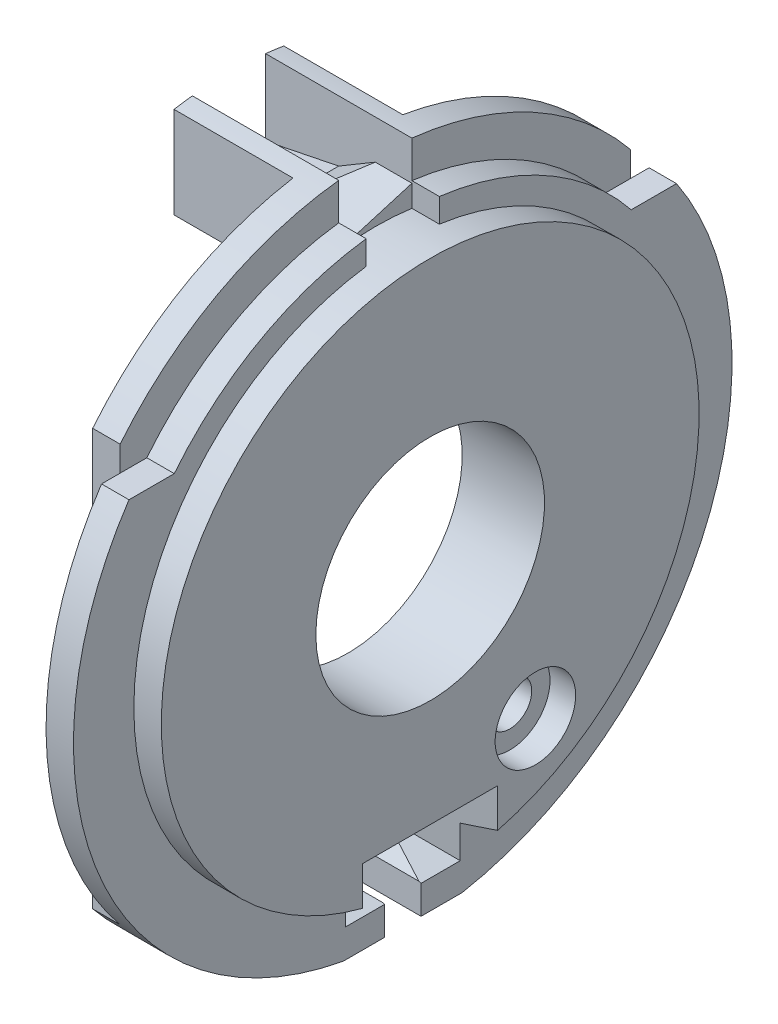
ISO-10303-21;
HEADER;
FILE_DESCRIPTION(('STEP AP214'),'2;1');
FILE_NAME('part.step','',(''),(''),'','','');
FILE_SCHEMA(('AUTOMOTIVE_DESIGN { 1 0 10303 214 1 1 1 1 }'));
ENDSEC;
DATA;
#1=APPLICATION_CONTEXT('core data for automotive mechanical design processes');
#2=APPLICATION_PROTOCOL_DEFINITION('international standard','automotive_design',2000,#1);
#3=PRODUCT_CONTEXT('',#1,'mechanical');
#4=PRODUCT('Part','Part','',(#3));
#5=PRODUCT_RELATED_PRODUCT_CATEGORY('part','',(#4));
#6=PRODUCT_DEFINITION_FORMATION('','',#4);
#7=PRODUCT_DEFINITION_CONTEXT('part definition',#1,'design');
#8=PRODUCT_DEFINITION('design','',#6,#7);
#9=PRODUCT_DEFINITION_SHAPE('','',#8);
#10=(LENGTH_UNIT() NAMED_UNIT(*) SI_UNIT(.MILLI.,.METRE.));
#11=(NAMED_UNIT(*) PLANE_ANGLE_UNIT() SI_UNIT($,.RADIAN.));
#12=(NAMED_UNIT(*) SI_UNIT($,.STERADIAN.) SOLID_ANGLE_UNIT());
#13=UNCERTAINTY_MEASURE_WITH_UNIT(LENGTH_MEASURE(1.E-05),#10,'distance_accuracy_value','');
#14=(GEOMETRIC_REPRESENTATION_CONTEXT(3) GLOBAL_UNCERTAINTY_ASSIGNED_CONTEXT((#13)) GLOBAL_UNIT_ASSIGNED_CONTEXT((#10,
#11,#12)) REPRESENTATION_CONTEXT('',''));
#15=CARTESIAN_POINT('',(0.,0.,0.));
#16=DIRECTION('',(0.,0.,1.));
#17=DIRECTION('',(1.,0.,0.));
#18=AXIS2_PLACEMENT_3D('',#15,#16,#17);
#19=CARTESIAN_POINT('',(-5.5,15.75,-2.));
#20=DIRECTION('',(0.,0.958699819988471,0.284419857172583));
#21=DIRECTION('',(0.,-0.284419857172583,0.958699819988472));
#22=AXIS2_PLACEMENT_3D('',#19,#20,#21);
#23=PLANE('',#22);
#24=DIRECTION('',(1.,0.,0.));
#25=VECTOR('',#24,1.);
#26=CARTESIAN_POINT('',(-5.5,15.75,-2.));
#27=LINE('',#26,#25);
#28=CARTESIAN_POINT('',(-3.5,15.75,-2.));
#29=VERTEX_POINT('',#28);
#30=CARTESIAN_POINT('',(-1.5,15.75,-2.));
#31=VERTEX_POINT('',#30);
#32=EDGE_CURVE('E380',#29,#31,#27,.T.);
#33=ORIENTED_EDGE('',*,*,#32,.F.);
#34=DIRECTION('',(0.432254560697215,0.256476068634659,-0.864509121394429));
#35=VECTOR('',#34,1.);
#36=CARTESIAN_POINT('',(-11.4793818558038,11.0154739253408,13.9587637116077));
#37=LINE('',#36,#35);
#38=CARTESIAN_POINT('',(-5.5,14.5633100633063,2.));
#39=VERTEX_POINT('',#38);
#40=EDGE_CURVE('E370',#39,#29,#37,.T.);
#41=ORIENTED_EDGE('',*,*,#40,.F.);
#42=DIRECTION('',(1.,0.,0.));
#43=VECTOR('',#42,1.);
#44=CARTESIAN_POINT('',(-5.5,14.5633100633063,2.));
#45=LINE('',#44,#43);
#46=CARTESIAN_POINT('',(-1.5,14.5633100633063,2.));
#47=VERTEX_POINT('',#46);
#48=EDGE_CURVE('E365',#39,#47,#45,.T.);
#49=ORIENTED_EDGE('',*,*,#48,.T.);
#50=DIRECTION('',(0.,-0.284419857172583,0.958699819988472));
#51=VECTOR('',#50,1.);
#52=CARTESIAN_POINT('',(-1.5,15.75,-2.));
#53=LINE('',#52,#51);
#54=EDGE_CURVE('E376',#31,#47,#53,.T.);
#55=ORIENTED_EDGE('',*,*,#54,.F.);
#56=EDGE_LOOP('',(#33,#41,#49,#55));
#57=FACE_BOUND('',#56,.T.);
#58=ADVANCED_FACE('F17',(#57),#23,.T.);
#59=CARTESIAN_POINT('',(1.5,13.75,2.));
#60=DIRECTION('',(0.,0.,1.));
#61=DIRECTION('',(0.,-1.,0.));
#62=AXIS2_PLACEMENT_3D('',#59,#60,#61);
#63=PLANE('',#62);
#64=DIRECTION('',(0.,1.,0.));
#65=VECTOR('',#64,1.);
#66=CARTESIAN_POINT('',(0.,14.7,2.));
#67=LINE('',#66,#65);
#68=CARTESIAN_POINT('',(0.,14.5633100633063,2.));
#69=VERTEX_POINT('',#68);
#70=CARTESIAN_POINT('',(0.,15.8745078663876,2.));
#71=VERTEX_POINT('',#70);
#72=EDGE_CURVE('E368',#69,#71,#67,.T.);
#73=ORIENTED_EDGE('',*,*,#72,.F.);
#74=DIRECTION('',(1.,0.,0.));
#75=VECTOR('',#74,1.);
#76=CARTESIAN_POINT('',(-12.001,14.5633100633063,2.));
#77=LINE('',#76,#75);
#78=EDGE_CURVE('E357',#47,#69,#77,.T.);
#79=ORIENTED_EDGE('',*,*,#78,.F.);
#80=ORIENTED_EDGE('',*,*,#48,.F.);
#81=DIRECTION('',(0.979948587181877,0.199250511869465,0.));
#82=VECTOR('',#81,1.);
#83=CARTESIAN_POINT('',(-5.5,14.5633100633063,2.));
#84=LINE('',#83,#82);
#85=CARTESIAN_POINT('',(-9.5,13.75,2.));
#86=VERTEX_POINT('',#85);
#87=EDGE_CURVE('E898',#86,#39,#84,.T.);
#88=ORIENTED_EDGE('',*,*,#87,.F.);
#89=DIRECTION('',(0.,1.,0.));
#90=VECTOR('',#89,1.);
#91=CARTESIAN_POINT('',(-9.5,13.75,2.));
#92=LINE('',#91,#90);
#93=CARTESIAN_POINT('',(-9.5,17.8885438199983,2.));
#94=VERTEX_POINT('',#93);
#95=EDGE_CURVE('E433',#86,#94,#92,.T.);
#96=ORIENTED_EDGE('',*,*,#95,.T.);
#97=DIRECTION('',(-1.,0.,0.));
#98=VECTOR('',#97,1.);
#99=CARTESIAN_POINT('',(1.5,17.8885438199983,2.));
#100=LINE('',#99,#98);
#101=CARTESIAN_POINT('',(-1.5,17.8885438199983,2.));
#102=VERTEX_POINT('',#101);
#103=EDGE_CURVE('E437',#102,#94,#100,.T.);
#104=ORIENTED_EDGE('',*,*,#103,.F.);
#105=DIRECTION('',(0.,1.,0.));
#106=VECTOR('',#105,1.);
#107=CARTESIAN_POINT('',(-1.5,13.75,2.));
#108=LINE('',#107,#106);
#109=CARTESIAN_POINT('',(-1.5,15.8745078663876,2.));
#110=VERTEX_POINT('',#109);
#111=EDGE_CURVE('E416',#110,#102,#108,.T.);
#112=ORIENTED_EDGE('',*,*,#111,.F.);
#113=DIRECTION('',(1.,0.,0.));
#114=VECTOR('',#113,1.);
#115=CARTESIAN_POINT('',(-42.4878030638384,15.8745078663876,2.));
#116=LINE('',#115,#114);
#117=EDGE_CURVE('E420',#110,#71,#116,.T.);
#118=ORIENTED_EDGE('',*,*,#117,.T.);
#119=EDGE_LOOP('',(#73,#79,#80,#88,#96,#104,#112,#118));
#120=FACE_BOUND('',#119,.T.);
#121=ADVANCED_FACE('F363',(#120),#63,.F.);
#122=CARTESIAN_POINT('',(1.5,17.8885438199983,-2.));
#123=DIRECTION('',(0.,0.,-1.));
#124=DIRECTION('',(0.,1.,0.));
#125=AXIS2_PLACEMENT_3D('',#122,#123,#124);
#126=PLANE('',#125);
#127=DIRECTION('',(0.,1.,0.));
#128=VECTOR('',#127,1.);
#129=CARTESIAN_POINT('',(-1.5,13.75,-2.));
#130=LINE('',#129,#128);
#131=CARTESIAN_POINT('',(-1.5,14.5633100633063,-2.));
#132=VERTEX_POINT('',#131);
#133=EDGE_CURVE('E40',#132,#31,#130,.T.);
#134=ORIENTED_EDGE('',*,*,#133,.F.);
#135=DIRECTION('',(1.,0.,0.));
#136=VECTOR('',#135,1.);
#137=CARTESIAN_POINT('',(-12.001,14.5633100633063,-2.));
#138=LINE('',#137,#136);
#139=CARTESIAN_POINT('',(0.,14.5633100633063,-2.));
#140=VERTEX_POINT('',#139);
#141=EDGE_CURVE('E33',#132,#140,#138,.T.);
#142=ORIENTED_EDGE('',*,*,#141,.T.);
#143=DIRECTION('',(0.,-1.,0.));
#144=VECTOR('',#143,1.);
#145=CARTESIAN_POINT('',(0.,14.7,-2.));
#146=LINE('',#145,#144);
#147=CARTESIAN_POINT('',(0.,15.8745078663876,-2.));
#148=VERTEX_POINT('',#147);
#149=EDGE_CURVE('E439',#148,#140,#146,.T.);
#150=ORIENTED_EDGE('',*,*,#149,.F.);
#151=DIRECTION('',(1.,0.,0.));
#152=VECTOR('',#151,1.);
#153=CARTESIAN_POINT('',(-42.4878030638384,15.8745078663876,-2.));
#154=LINE('',#153,#152);
#155=CARTESIAN_POINT('',(-1.5,15.8745078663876,-2.));
#156=VERTEX_POINT('',#155);
#157=EDGE_CURVE('E11',#148,#156,#154,.F.);
#158=ORIENTED_EDGE('',*,*,#157,.T.);
#159=DIRECTION('',(0.,-1.,0.));
#160=VECTOR('',#159,1.);
#161=CARTESIAN_POINT('',(-1.5,17.8885438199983,-2.));
#162=LINE('',#161,#160);
#163=CARTESIAN_POINT('',(-1.5,17.8885438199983,-2.));
#164=VERTEX_POINT('',#163);
#165=EDGE_CURVE('E26',#164,#156,#162,.T.);
#166=ORIENTED_EDGE('',*,*,#165,.F.);
#167=DIRECTION('',(-1.,0.,0.));
#168=VECTOR('',#167,1.);
#169=CARTESIAN_POINT('',(1.5,17.8885438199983,-2.));
#170=LINE('',#169,#168);
#171=CARTESIAN_POINT('',(-9.5,17.8885438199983,-2.));
#172=VERTEX_POINT('',#171);
#173=EDGE_CURVE('E436',#164,#172,#170,.T.);
#174=ORIENTED_EDGE('',*,*,#173,.T.);
#175=DIRECTION('',(0.,-1.,0.));
#176=VECTOR('',#175,1.);
#177=CARTESIAN_POINT('',(-9.5,17.8885438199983,-2.));
#178=LINE('',#177,#176);
#179=CARTESIAN_POINT('',(-9.5,13.75,-2.));
#180=VERTEX_POINT('',#179);
#181=EDGE_CURVE('E428',#172,#180,#178,.T.);
#182=ORIENTED_EDGE('',*,*,#181,.T.);
#183=DIRECTION('',(0.979948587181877,0.199250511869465,0.));
#184=VECTOR('',#183,1.);
#185=CARTESIAN_POINT('',(-5.5,14.5633100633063,-2.));
#186=LINE('',#185,#184);
#187=CARTESIAN_POINT('',(-5.5,14.5633100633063,-2.));
#188=VERTEX_POINT('',#187);
#189=EDGE_CURVE('E899',#180,#188,#186,.T.);
#190=ORIENTED_EDGE('',*,*,#189,.T.);
#191=DIRECTION('',(0.86000761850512,0.510281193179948,0.));
#192=VECTOR('',#191,1.);
#193=CARTESIAN_POINT('',(-5.5,14.5633100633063,-2.));
#194=LINE('',#193,#192);
#195=EDGE_CURVE('E900',#188,#29,#194,.T.);
#196=ORIENTED_EDGE('',*,*,#195,.T.);
#197=ORIENTED_EDGE('',*,*,#32,.T.);
#198=EDGE_LOOP('',(#134,#142,#150,#158,#166,#174,#182,#190,#196,#197));
#199=FACE_BOUND('',#198,.T.);
#200=ADVANCED_FACE('F633',(#199),#126,.F.);
#201=CARTESIAN_POINT('',(-65.114406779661,0.,0.));
#202=DIRECTION('',(-1.,0.,0.));
#203=DIRECTION('',(0.,0.,1.));
#204=AXIS2_PLACEMENT_3D('',#201,#202,#203);
#205=CYLINDRICAL_SURFACE('',#204,18.);
#206=CARTESIAN_POINT('',(-1.5,0.,0.));
#207=DIRECTION('',(1.,0.,0.));
#208=DIRECTION('',(0.,0.,-1.));
#209=AXIS2_PLACEMENT_3D('',#206,#207,#208);
#210=CIRCLE('',#209,18.);
#211=CARTESIAN_POINT('',(-1.5,11.3753021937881,13.95));
#212=VERTEX_POINT('',#211);
#213=EDGE_CURVE('E418',#102,#212,#210,.T.);
#214=ORIENTED_EDGE('',*,*,#213,.F.);
#215=ORIENTED_EDGE('',*,*,#103,.T.);
#216=CARTESIAN_POINT('',(-9.5,0.,0.));
#217=DIRECTION('',(-1.,0.,0.));
#218=DIRECTION('',(0.,0.,1.));
#219=AXIS2_PLACEMENT_3D('',#216,#217,#218);
#220=CIRCLE('',#219,18.);
#221=CARTESIAN_POINT('',(-9.5,17.7482393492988,3.));
#222=VERTEX_POINT('',#221);
#223=EDGE_CURVE('E1426',#222,#94,#220,.T.);
#224=ORIENTED_EDGE('',*,*,#223,.F.);
#225=DIRECTION('',(1.,0.,0.));
#226=VECTOR('',#225,1.);
#227=CARTESIAN_POINT('',(-9.5,17.7482393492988,3.));
#228=LINE('',#227,#226);
#229=CARTESIAN_POINT('',(-3.,17.7482393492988,3.));
#230=VERTEX_POINT('',#229);
#231=EDGE_CURVE('E1380',#222,#230,#228,.T.);
#232=ORIENTED_EDGE('',*,*,#231,.T.);
#233=CARTESIAN_POINT('',(-3.,0.,0.));
#234=DIRECTION('',(-1.,0.,0.));
#235=DIRECTION('',(0.,0.,1.));
#236=AXIS2_PLACEMENT_3D('',#233,#234,#235);
#237=CIRCLE('',#236,18.);
#238=CARTESIAN_POINT('',(-3.,11.3753021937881,13.95));
#239=VERTEX_POINT('',#238);
#240=EDGE_CURVE('E663',#239,#230,#237,.T.);
#241=ORIENTED_EDGE('',*,*,#240,.F.);
#242=DIRECTION('',(-1.,0.,0.));
#243=VECTOR('',#242,1.);
#244=CARTESIAN_POINT('',(-65.114406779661,11.3753021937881,13.95));
#245=LINE('',#244,#243);
#246=EDGE_CURVE('E677',#239,#212,#245,.F.);
#247=ORIENTED_EDGE('',*,*,#246,.T.);
#248=EDGE_LOOP('',(#214,#215,#224,#232,#241,#247));
#249=FACE_BOUND('',#248,.T.);
#250=ADVANCED_FACE('F804',(#249),#205,.T.);
#251=CARTESIAN_POINT('',(-1.5,0.,0.));
#252=DIRECTION('',(1.,0.,0.));
#253=DIRECTION('',(0.,0.,-1.));
#254=AXIS2_PLACEMENT_3D('',#251,#252,#253);
#255=CIRCLE('',#254,18.);
#256=CARTESIAN_POINT('',(-1.5,11.3753021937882,-13.95));
#257=VERTEX_POINT('',#256);
#258=EDGE_CURVE('E412',#257,#164,#255,.T.);
#259=ORIENTED_EDGE('',*,*,#258,.F.);
#260=DIRECTION('',(-1.,0.,0.));
#261=VECTOR('',#260,1.);
#262=CARTESIAN_POINT('',(-65.114406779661,11.3753021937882,-13.95));
#263=LINE('',#262,#261);
#264=CARTESIAN_POINT('',(-3.,11.3753021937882,-13.95));
#265=VERTEX_POINT('',#264);
#266=EDGE_CURVE('E665',#257,#265,#263,.T.);
#267=ORIENTED_EDGE('',*,*,#266,.T.);
#268=CARTESIAN_POINT('',(-3.,17.7482393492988,-3.));
#269=VERTEX_POINT('',#268);
#270=EDGE_CURVE('E656',#269,#265,#237,.T.);
#271=ORIENTED_EDGE('',*,*,#270,.F.);
#272=DIRECTION('',(1.,0.,0.));
#273=VECTOR('',#272,1.);
#274=CARTESIAN_POINT('',(-9.5,17.7482393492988,-3.));
#275=LINE('',#274,#273);
#276=CARTESIAN_POINT('',(-9.5,17.7482393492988,-3.));
#277=VERTEX_POINT('',#276);
#278=EDGE_CURVE('E1378',#277,#269,#275,.T.);
#279=ORIENTED_EDGE('',*,*,#278,.F.);
#280=EDGE_CURVE('E887',#172,#277,#220,.T.);
#281=ORIENTED_EDGE('',*,*,#280,.F.);
#282=ORIENTED_EDGE('',*,*,#173,.F.);
#283=EDGE_LOOP('',(#259,#267,#271,#279,#281,#282));
#284=FACE_BOUND('',#283,.T.);
#285=ADVANCED_FACE('F883',(#284),#205,.T.);
#286=CARTESIAN_POINT('',(0.,0.,0.));
#287=DIRECTION('',(-1.,0.,0.));
#288=DIRECTION('',(0.,0.,1.));
#289=AXIS2_PLACEMENT_3D('',#286,#287,#288);
#290=CIRCLE('',#289,18.);
#291=CARTESIAN_POINT('',(0.,-17.7041661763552,3.25));
#292=VERTEX_POINT('',#291);
#293=CARTESIAN_POINT('',(0.,10.,14.9666295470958));
#294=VERTEX_POINT('',#293);
#295=EDGE_CURVE('E648',#292,#294,#290,.T.);
#296=ORIENTED_EDGE('',*,*,#295,.T.);
#297=DIRECTION('',(-1.,0.,0.));
#298=VECTOR('',#297,1.);
#299=CARTESIAN_POINT('',(-65.114406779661,10.,14.9666295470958));
#300=LINE('',#299,#298);
#301=CARTESIAN_POINT('',(-1.5,10.,14.9666295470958));
#302=VERTEX_POINT('',#301);
#303=EDGE_CURVE('E425',#294,#302,#300,.T.);
#304=ORIENTED_EDGE('',*,*,#303,.T.);
#305=CARTESIAN_POINT('',(-1.5,0.,0.));
#306=DIRECTION('',(1.,0.,0.));
#307=DIRECTION('',(0.,0.,-1.));
#308=AXIS2_PLACEMENT_3D('',#305,#306,#307);
#309=CIRCLE('',#308,18.);
#310=CARTESIAN_POINT('',(-1.5,-11.3753021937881,13.95));
#311=VERTEX_POINT('',#310);
#312=EDGE_CURVE('E680',#302,#311,#309,.T.);
#313=ORIENTED_EDGE('',*,*,#312,.T.);
#314=DIRECTION('',(-1.,0.,0.));
#315=VECTOR('',#314,1.);
#316=CARTESIAN_POINT('',(-65.114406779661,-11.3753021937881,13.95));
#317=LINE('',#316,#315);
#318=CARTESIAN_POINT('',(-3.,-11.3753021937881,13.95));
#319=VERTEX_POINT('',#318);
#320=EDGE_CURVE('E674',#311,#319,#317,.T.);
#321=ORIENTED_EDGE('',*,*,#320,.T.);
#322=CARTESIAN_POINT('',(-3.,-17.7041661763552,3.25));
#323=VERTEX_POINT('',#322);
#324=EDGE_CURVE('E651',#323,#319,#237,.T.);
#325=ORIENTED_EDGE('',*,*,#324,.F.);
#326=DIRECTION('',(1.,0.,0.));
#327=VECTOR('',#326,1.);
#328=CARTESIAN_POINT('',(-89.0651913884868,-17.7041661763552,3.25));
#329=LINE('',#328,#327);
#330=EDGE_CURVE('E525',#323,#292,#329,.T.);
#331=ORIENTED_EDGE('',*,*,#330,.T.);
#332=EDGE_LOOP('',(#296,#304,#313,#321,#325,#331));
#333=FACE_BOUND('',#332,.T.);
#334=ADVANCED_FACE('F784',(#333),#205,.T.);
#335=CARTESIAN_POINT('',(0.,14.7,0.));
#336=DIRECTION('',(-1.,0.,0.));
#337=DIRECTION('',(0.,0.,1.));
#338=AXIS2_PLACEMENT_3D('',#335,#336,#337);
#339=PLANE('',#338);
#340=ORIENTED_EDGE('',*,*,#72,.T.);
#341=CARTESIAN_POINT('',(0.,0.,0.));
#342=DIRECTION('',(-1.,0.,0.));
#343=DIRECTION('',(0.,0.,-1.));
#344=AXIS2_PLACEMENT_3D('',#341,#342,#343);
#345=CIRCLE('',#344,16.);
#346=CARTESIAN_POINT('',(0.,10.,12.4899959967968));
#347=VERTEX_POINT('',#346);
#348=EDGE_CURVE('E398',#347,#71,#345,.T.);
#349=ORIENTED_EDGE('',*,*,#348,.F.);
#350=DIRECTION('',(0.,0.,-1.));
#351=VECTOR('',#350,1.);
#352=CARTESIAN_POINT('',(0.,10.,19.5959179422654));
#353=LINE('',#352,#351);
#354=EDGE_CURVE('E402',#294,#347,#353,.T.);
#355=ORIENTED_EDGE('',*,*,#354,.F.);
#356=ORIENTED_EDGE('',*,*,#295,.F.);
#357=DIRECTION('',(0.,0.,-1.));
#358=VECTOR('',#357,1.);
#359=CARTESIAN_POINT('',(0.,-17.7041661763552,0.));
#360=LINE('',#359,#358);
#361=CARTESIAN_POINT('',(0.,-17.7041661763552,1.));
#362=VERTEX_POINT('',#361);
#363=EDGE_CURVE('E538',#292,#362,#360,.T.);
#364=ORIENTED_EDGE('',*,*,#363,.T.);
#365=DIRECTION('',(0.,1.,0.));
#366=VECTOR('',#365,1.);
#367=CARTESIAN_POINT('',(0.,14.7,1.));
#368=LINE('',#367,#366);
#369=CARTESIAN_POINT('',(0.,-16.1419107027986,1.));
#370=VERTEX_POINT('',#369);
#371=EDGE_CURVE('E573',#362,#370,#368,.T.);
#372=ORIENTED_EDGE('',*,*,#371,.T.);
#373=DIRECTION('',(0.,0.,1.));
#374=VECTOR('',#373,1.);
#375=CARTESIAN_POINT('',(0.,-16.1419107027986,0.));
#376=LINE('',#375,#374);
#377=CARTESIAN_POINT('',(0.,-16.1419107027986,3.14191070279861));
#378=VERTEX_POINT('',#377);
#379=EDGE_CURVE('E519',#370,#378,#376,.T.);
#380=ORIENTED_EDGE('',*,*,#379,.T.);
#381=DIRECTION('',(0.,1.,0.));
#382=VECTOR('',#381,1.);
#383=CARTESIAN_POINT('',(0.,14.7,3.14191070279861));
#384=LINE('',#383,#382);
#385=CARTESIAN_POINT('',(0.,-14.3603063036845,3.14191070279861));
#386=VERTEX_POINT('',#385);
#387=EDGE_CURVE('E506',#378,#386,#384,.T.);
#388=ORIENTED_EDGE('',*,*,#387,.T.);
#389=CARTESIAN_POINT('',(0.,0.,0.));
#390=DIRECTION('',(-1.,0.,0.));
#391=DIRECTION('',(0.,0.,1.));
#392=AXIS2_PLACEMENT_3D('',#389,#390,#391);
#393=CIRCLE('',#392,14.7);
#394=EDGE_CURVE('E640',#386,#69,#393,.T.);
#395=ORIENTED_EDGE('',*,*,#394,.T.);
#396=EDGE_LOOP('',(#340,#349,#355,#356,#364,#372,#380,#388,#395));
#397=FACE_BOUND('',#396,.T.);
#398=ADVANCED_FACE('F696',(#397),#339,.F.);
#399=CARTESIAN_POINT('',(-3.,18.,0.));
#400=DIRECTION('',(1.,0.,0.));
#401=DIRECTION('',(0.,0.,-1.));
#402=AXIS2_PLACEMENT_3D('',#399,#400,#401);
#403=PLANE('',#402);
#404=CARTESIAN_POINT('',(-3.,-9.95929214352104,-5.75));
#405=DIRECTION('',(1.,0.,0.));
#406=DIRECTION('',(0.,0.,-1.));
#407=AXIS2_PLACEMENT_3D('',#404,#405,#406);
#408=CIRCLE('',#407,1.2);
#409=CARTESIAN_POINT('',(-3.,-9.95929214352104,-6.95));
#410=VERTEX_POINT('',#409);
#411=EDGE_CURVE('E21',#410,#410,#408,.T.);
#412=ORIENTED_EDGE('',*,*,#411,.T.);
#413=EDGE_LOOP('',(#412));
#414=FACE_BOUND('',#413,.T.);
#415=CARTESIAN_POINT('',(-3.,0.,0.));
#416=DIRECTION('',(-1.,0.,0.));
#417=DIRECTION('',(0.,0.,1.));
#418=AXIS2_PLACEMENT_3D('',#415,#416,#417);
#419=CIRCLE('',#418,6.25);
#420=CARTESIAN_POINT('',(-3.,0.,6.25));
#421=VERTEX_POINT('',#420);
#422=EDGE_CURVE('E657',#421,#421,#419,.T.);
#423=ORIENTED_EDGE('',*,*,#422,.F.);
#424=EDGE_LOOP('',(#423));
#425=FACE_BOUND('',#424,.T.);
#426=DIRECTION('',(0.,0.,-1.));
#427=VECTOR('',#426,1.);
#428=CARTESIAN_POINT('',(-3.,-12.6858222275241,0.));
#429=LINE('',#428,#427);
#430=CARTESIAN_POINT('',(-3.,-12.6858222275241,-1.27765974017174));
#431=VERTEX_POINT('',#430);
#432=CARTESIAN_POINT('',(-3.,-12.6858222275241,-3.25));
#433=VERTEX_POINT('',#432);
#434=EDGE_CURVE('E468',#431,#433,#429,.T.);
#435=ORIENTED_EDGE('',*,*,#434,.F.);
#436=CARTESIAN_POINT('',(-3.,0.,0.));
#437=DIRECTION('',(-1.,0.,0.));
#438=DIRECTION('',(0.,0.,1.));
#439=AXIS2_PLACEMENT_3D('',#436,#437,#438);
#440=CIRCLE('',#439,12.75);
#441=CARTESIAN_POINT('',(-3.,-11.9935325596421,-4.32639304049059));
#442=VERTEX_POINT('',#441);
#443=EDGE_CURVE('E703',#442,#431,#440,.T.);
#444=ORIENTED_EDGE('',*,*,#443,.F.);
#445=DIRECTION('',(0.,-0.866025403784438,-0.5));
#446=VECTOR('',#445,1.);
#447=CARTESIAN_POINT('',(-3.,-8.22363543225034,-2.14984191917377));
#448=LINE('',#447,#446);
#449=CARTESIAN_POINT('',(-3.,-8.22363543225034,-2.14984191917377));
#450=VERTEX_POINT('',#449);
#451=EDGE_CURVE('E719',#450,#442,#448,.T.);
#452=ORIENTED_EDGE('',*,*,#451,.F.);
#453=CARTESIAN_POINT('',(-3.,0.,0.));
#454=DIRECTION('',(1.,0.,0.));
#455=DIRECTION('',(0.,0.,1.));
#456=AXIS2_PLACEMENT_3D('',#453,#454,#455);
#457=CIRCLE('',#456,8.5);
#458=CARTESIAN_POINT('',(-3.,-5.97363543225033,-6.04695623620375));
#459=VERTEX_POINT('',#458);
#460=EDGE_CURVE('E1393',#459,#450,#457,.T.);
#461=ORIENTED_EDGE('',*,*,#460,.F.);
#462=DIRECTION('',(0.,0.866025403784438,0.5));
#463=VECTOR('',#462,1.);
#464=CARTESIAN_POINT('',(-3.,-5.97363543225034,-6.04695623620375));
#465=LINE('',#464,#463);
#466=CARTESIAN_POINT('',(-3.,-9.74353255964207,-8.22350735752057));
#467=VERTEX_POINT('',#466);
#468=EDGE_CURVE('E1391',#467,#459,#465,.T.);
#469=ORIENTED_EDGE('',*,*,#468,.F.);
#470=CARTESIAN_POINT('',(-3.,0.,0.));
#471=DIRECTION('',(-1.,0.,0.));
#472=DIRECTION('',(0.,0.,1.));
#473=AXIS2_PLACEMENT_3D('',#470,#471,#472);
#474=CIRCLE('',#473,12.75);
#475=CARTESIAN_POINT('',(-3.,-5.6089214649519,-11.45));
#476=VERTEX_POINT('',#475);
#477=EDGE_CURVE('E1388',#476,#467,#474,.T.);
#478=ORIENTED_EDGE('',*,*,#477,.F.);
#479=DIRECTION('',(0.,-1.,0.));
#480=VECTOR('',#479,1.);
#481=CARTESIAN_POINT('',(-3.,5.60892146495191,-11.45));
#482=LINE('',#481,#480);
#483=CARTESIAN_POINT('',(-3.,5.60892146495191,-11.45));
#484=VERTEX_POINT('',#483);
#485=EDGE_CURVE('E1363',#484,#476,#482,.T.);
#486=ORIENTED_EDGE('',*,*,#485,.F.);
#487=CARTESIAN_POINT('',(-3.,0.,0.));
#488=DIRECTION('',(-1.,0.,0.));
#489=DIRECTION('',(0.,0.,1.));
#490=AXIS2_PLACEMENT_3D('',#487,#488,#489);
#491=CIRCLE('',#490,12.75);
#492=CARTESIAN_POINT('',(-3.,12.75,0.));
#493=VERTEX_POINT('',#492);
#494=EDGE_CURVE('E1360',#493,#484,#491,.T.);
#495=ORIENTED_EDGE('',*,*,#494,.F.);
#496=DIRECTION('',(0.,0.,1.));
#497=VECTOR('',#496,1.);
#498=CARTESIAN_POINT('',(-3.,12.75,-3.));
#499=LINE('',#498,#497);
#500=CARTESIAN_POINT('',(-3.,12.75,-3.));
#501=VERTEX_POINT('',#500);
#502=EDGE_CURVE('E602',#501,#493,#499,.T.);
#503=ORIENTED_EDGE('',*,*,#502,.F.);
#504=DIRECTION('',(0.,-1.,0.));
#505=VECTOR('',#504,1.);
#506=CARTESIAN_POINT('',(-3.,17.7482393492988,-3.));
#507=LINE('',#506,#505);
#508=EDGE_CURVE('E608',#269,#501,#507,.T.);
#509=ORIENTED_EDGE('',*,*,#508,.F.);
#510=ORIENTED_EDGE('',*,*,#270,.T.);
#511=DIRECTION('',(0.,1.,0.));
#512=VECTOR('',#511,1.);
#513=CARTESIAN_POINT('',(-3.,-20.,-13.9500000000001));
#514=LINE('',#513,#512);
#515=CARTESIAN_POINT('',(-3.,-11.375302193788,-13.95));
#516=VERTEX_POINT('',#515);
#517=EDGE_CURVE('E750',#516,#265,#514,.T.);
#518=ORIENTED_EDGE('',*,*,#517,.F.);
#519=CARTESIAN_POINT('',(-3.,-17.7041661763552,-3.25));
#520=VERTEX_POINT('',#519);
#521=EDGE_CURVE('E652',#516,#520,#237,.T.);
#522=ORIENTED_EDGE('',*,*,#521,.T.);
#523=DIRECTION('',(0.,-1.,0.));
#524=VECTOR('',#523,1.);
#525=CARTESIAN_POINT('',(-3.,-12.75,-3.25));
#526=LINE('',#525,#524);
#527=EDGE_CURVE('E576',#433,#520,#526,.T.);
#528=ORIENTED_EDGE('',*,*,#527,.F.);
#529=EDGE_LOOP('',(#435,#444,#452,#461,#469,#478,#486,#495,#503,#509,#510,#518,#522,#528));
#530=FACE_BOUND('',#529,.T.);
#531=ADVANCED_FACE('F692',(#414,#425,#530),#403,.F.);
#532=DIRECTION('',(0.,0.,-1.));
#533=VECTOR('',#532,1.);
#534=CARTESIAN_POINT('',(-3.,-12.6858222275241,0.));
#535=LINE('',#534,#533);
#536=CARTESIAN_POINT('',(-3.,-12.6858222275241,3.25));
#537=VERTEX_POINT('',#536);
#538=CARTESIAN_POINT('',(-3.,-12.6858222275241,1.27765974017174));
#539=VERTEX_POINT('',#538);
#540=EDGE_CURVE('E472',#537,#539,#535,.T.);
#541=ORIENTED_EDGE('',*,*,#540,.F.);
#542=DIRECTION('',(0.,1.,0.));
#543=VECTOR('',#542,1.);
#544=CARTESIAN_POINT('',(-3.,-12.75,3.25));
#545=LINE('',#544,#543);
#546=EDGE_CURVE('E578',#323,#537,#545,.T.);
#547=ORIENTED_EDGE('',*,*,#546,.F.);
#548=ORIENTED_EDGE('',*,*,#324,.T.);
#549=DIRECTION('',(0.,-1.,0.));
#550=VECTOR('',#549,1.);
#551=CARTESIAN_POINT('',(-3.,20.,13.95));
#552=LINE('',#551,#550);
#553=EDGE_CURVE('E769',#239,#319,#552,.T.);
#554=ORIENTED_EDGE('',*,*,#553,.F.);
#555=ORIENTED_EDGE('',*,*,#240,.T.);
#556=DIRECTION('',(0.,1.,0.));
#557=VECTOR('',#556,1.);
#558=CARTESIAN_POINT('',(-3.,17.7482393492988,3.));
#559=LINE('',#558,#557);
#560=CARTESIAN_POINT('',(-3.,12.75,3.));
#561=VERTEX_POINT('',#560);
#562=EDGE_CURVE('E599',#561,#230,#559,.T.);
#563=ORIENTED_EDGE('',*,*,#562,.F.);
#564=EDGE_CURVE('E615',#493,#561,#499,.T.);
#565=ORIENTED_EDGE('',*,*,#564,.F.);
#566=CARTESIAN_POINT('',(-3.,5.60892146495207,11.45));
#567=VERTEX_POINT('',#566);
#568=EDGE_CURVE('E1357',#567,#493,#491,.T.);
#569=ORIENTED_EDGE('',*,*,#568,.F.);
#570=DIRECTION('',(0.,1.,0.));
#571=VECTOR('',#570,1.);
#572=CARTESIAN_POINT('',(-3.,5.60892146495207,11.45));
#573=LINE('',#572,#571);
#574=CARTESIAN_POINT('',(-3.,-5.60892146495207,11.45));
#575=VERTEX_POINT('',#574);
#576=EDGE_CURVE('E713',#575,#567,#573,.T.);
#577=ORIENTED_EDGE('',*,*,#576,.F.);
#578=EDGE_CURVE('E714',#539,#575,#440,.T.);
#579=ORIENTED_EDGE('',*,*,#578,.F.);
#580=EDGE_LOOP('',(#541,#547,#548,#554,#555,#563,#565,#569,#577,#579));
#581=FACE_BOUND('',#580,.T.);
#582=ADVANCED_FACE('F695',(#581),#403,.F.);
#583=CARTESIAN_POINT('',(0.,0.,0.));
#584=DIRECTION('',(-1.,0.,0.));
#585=DIRECTION('',(0.,0.,1.));
#586=AXIS2_PLACEMENT_3D('',#583,#584,#585);
#587=CYLINDRICAL_SURFACE('',#586,12.75);
#588=CARTESIAN_POINT('',(31.8540101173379,0.,0.));
#589=DIRECTION('',(0.342020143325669,-0.939692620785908,0.));
#590=DIRECTION('',(-0.939692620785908,-0.342020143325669,0.));
#591=AXIS2_PLACEMENT_3D('',#588,#589,#590);
#592=ELLIPSE('',#591,37.2785061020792,12.75);
#593=CARTESIAN_POINT('',(-2.01916643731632,-12.3288280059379,3.25));
#594=VERTEX_POINT('',#593);
#595=EDGE_CURVE('E469',#539,#594,#592,.F.);
#596=ORIENTED_EDGE('',*,*,#595,.F.);
#597=ORIENTED_EDGE('',*,*,#578,.T.);
#598=DIRECTION('',(-1.,0.,0.));
#599=VECTOR('',#598,1.);
#600=CARTESIAN_POINT('',(0.,-5.60892146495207,11.45));
#601=LINE('',#600,#599);
#602=CARTESIAN_POINT('',(0.,-5.60892146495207,11.45));
#603=VERTEX_POINT('',#602);
#604=EDGE_CURVE('E751',#603,#575,#601,.T.);
#605=ORIENTED_EDGE('',*,*,#604,.F.);
#606=CARTESIAN_POINT('',(0.,0.,0.));
#607=DIRECTION('',(-1.,0.,0.));
#608=DIRECTION('',(0.,0.,1.));
#609=AXIS2_PLACEMENT_3D('',#606,#607,#608);
#610=CIRCLE('',#609,12.75);
#611=CARTESIAN_POINT('',(0.,-12.3288280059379,3.25));
#612=VERTEX_POINT('',#611);
#613=EDGE_CURVE('E740',#612,#603,#610,.T.);
#614=ORIENTED_EDGE('',*,*,#613,.F.);
#615=DIRECTION('',(-1.,0.,0.));
#616=VECTOR('',#615,1.);
#617=CARTESIAN_POINT('',(0.,-12.3288280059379,3.25));
#618=LINE('',#617,#616);
#619=EDGE_CURVE('E460',#612,#594,#618,.T.);
#620=ORIENTED_EDGE('',*,*,#619,.T.);
#621=EDGE_LOOP('',(#596,#597,#605,#614,#620));
#622=FACE_BOUND('',#621,.T.);
#623=ADVANCED_FACE('F1038',(#622),#587,.F.);
#624=CARTESIAN_POINT('',(-2.01916643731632,-12.3288280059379,-3.25));
#625=VERTEX_POINT('',#624);
#626=EDGE_CURVE('E466',#625,#431,#592,.F.);
#627=ORIENTED_EDGE('',*,*,#626,.F.);
#628=DIRECTION('',(-1.,0.,0.));
#629=VECTOR('',#628,1.);
#630=CARTESIAN_POINT('',(0.,-12.3288280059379,-3.25));
#631=LINE('',#630,#629);
#632=CARTESIAN_POINT('',(0.,-12.3288280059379,-3.25));
#633=VERTEX_POINT('',#632);
#634=EDGE_CURVE('E456',#633,#625,#631,.T.);
#635=ORIENTED_EDGE('',*,*,#634,.F.);
#636=CARTESIAN_POINT('',(0.,-11.9935325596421,-4.32639304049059));
#637=VERTEX_POINT('',#636);
#638=EDGE_CURVE('E741',#637,#633,#610,.T.);
#639=ORIENTED_EDGE('',*,*,#638,.F.);
#640=DIRECTION('',(-1.,0.,0.));
#641=VECTOR('',#640,1.);
#642=CARTESIAN_POINT('',(0.,-11.9935325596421,-4.32639304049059));
#643=LINE('',#642,#641);
#644=EDGE_CURVE('E711',#637,#442,#643,.T.);
#645=ORIENTED_EDGE('',*,*,#644,.T.);
#646=ORIENTED_EDGE('',*,*,#443,.T.);
#647=EDGE_LOOP('',(#627,#635,#639,#645,#646));
#648=FACE_BOUND('',#647,.T.);
#649=ADVANCED_FACE('F708',(#648),#587,.F.);
#650=CARTESIAN_POINT('',(-12.,-12.75,-3.25));
#651=DIRECTION('',(0.,-1.,0.));
#652=DIRECTION('',(0.,0.,-1.));
#653=AXIS2_PLACEMENT_3D('',#650,#651,#652);
#654=PLANE('',#653);
#655=DIRECTION('',(0.,0.,-1.));
#656=VECTOR('',#655,1.);
#657=CARTESIAN_POINT('',(-3.17632698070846,-12.75,3.25));
#658=LINE('',#657,#656);
#659=CARTESIAN_POINT('',(-3.17632698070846,-12.75,3.25));
#660=VERTEX_POINT('',#659);
#661=CARTESIAN_POINT('',(-3.17632698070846,-12.75,-3.25));
#662=VERTEX_POINT('',#661);
#663=EDGE_CURVE('E450',#660,#662,#658,.T.);
#664=ORIENTED_EDGE('',*,*,#663,.T.);
#665=DIRECTION('',(1.,0.,0.));
#666=VECTOR('',#665,1.);
#667=CARTESIAN_POINT('',(-12.,-12.75,-3.25));
#668=LINE('',#667,#666);
#669=CARTESIAN_POINT('',(-12.,-12.75,-3.25));
#670=VERTEX_POINT('',#669);
#671=EDGE_CURVE('E587',#670,#662,#668,.T.);
#672=ORIENTED_EDGE('',*,*,#671,.F.);
#673=DIRECTION('',(0.,0.,-1.));
#674=VECTOR('',#673,1.);
#675=CARTESIAN_POINT('',(-12.,-12.75,-3.25));
#676=LINE('',#675,#674);
#677=CARTESIAN_POINT('',(-12.,-12.75,3.25));
#678=VERTEX_POINT('',#677);
#679=EDGE_CURVE('E585',#678,#670,#676,.T.);
#680=ORIENTED_EDGE('',*,*,#679,.F.);
#681=DIRECTION('',(1.,0.,0.));
#682=VECTOR('',#681,1.);
#683=CARTESIAN_POINT('',(-12.,-12.75,3.25));
#684=LINE('',#683,#682);
#685=EDGE_CURVE('E590',#678,#660,#684,.T.);
#686=ORIENTED_EDGE('',*,*,#685,.T.);
#687=EDGE_LOOP('',(#664,#672,#680,#686));
#688=FACE_BOUND('',#687,.T.);
#689=ADVANCED_FACE('F945',(#688),#654,.F.);
#690=CARTESIAN_POINT('',(-65.114406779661,0.,0.));
#691=DIRECTION('',(-1.,0.,0.));
#692=DIRECTION('',(0.,0.,1.));
#693=AXIS2_PLACEMENT_3D('',#690,#691,#692);
#694=CYLINDRICAL_SURFACE('',#693,14.7);
#695=CARTESIAN_POINT('',(0.,-14.3603063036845,-3.14191070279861));
#696=VERTEX_POINT('',#695);
#697=EDGE_CURVE('E637',#140,#696,#393,.T.);
#698=ORIENTED_EDGE('',*,*,#697,.F.);
#699=ORIENTED_EDGE('',*,*,#141,.F.);
#700=CARTESIAN_POINT('',(-1.5,0.,0.));
#701=DIRECTION('',(-1.,0.,0.));
#702=DIRECTION('',(0.,0.,1.));
#703=AXIS2_PLACEMENT_3D('',#700,#701,#702);
#704=CIRCLE('',#703,14.7);
#705=EDGE_CURVE('E354',#132,#47,#704,.F.);
#706=ORIENTED_EDGE('',*,*,#705,.T.);
#707=ORIENTED_EDGE('',*,*,#78,.T.);
#708=ORIENTED_EDGE('',*,*,#394,.F.);
#709=CARTESIAN_POINT('',(-8.63232870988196,0.,0.));
#710=DIRECTION('',(-0.342020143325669,0.,0.939692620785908));
#711=DIRECTION('',(-0.939692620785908,0.,-0.342020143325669));
#712=AXIS2_PLACEMENT_3D('',#709,#710,#711);
#713=ELLIPSE('',#712,42.9799246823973,14.7);
#714=CARTESIAN_POINT('',(1.5,-14.2298855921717,3.68786605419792));
#715=VERTEX_POINT('',#714);
#716=EDGE_CURVE('E509',#386,#715,#713,.T.);
#717=ORIENTED_EDGE('',*,*,#716,.T.);
#718=CARTESIAN_POINT('',(1.5,0.,0.));
#719=DIRECTION('',(-1.,0.,0.));
#720=DIRECTION('',(0.,0.,1.));
#721=AXIS2_PLACEMENT_3D('',#718,#719,#720);
#722=CIRCLE('',#721,14.7);
#723=CARTESIAN_POINT('',(1.5,-14.2298855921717,-3.68786605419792));
#724=VERTEX_POINT('',#723);
#725=EDGE_CURVE('E682',#715,#724,#722,.T.);
#726=ORIENTED_EDGE('',*,*,#725,.T.);
#727=CARTESIAN_POINT('',(-8.63232870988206,0.,0.));
#728=DIRECTION('',(-0.342020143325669,0.,-0.939692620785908));
#729=DIRECTION('',(-0.939692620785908,0.,0.342020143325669));
#730=AXIS2_PLACEMENT_3D('',#727,#728,#729);
#731=ELLIPSE('',#730,42.9799246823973,14.7);
#732=EDGE_CURVE('E503',#724,#696,#731,.T.);
#733=ORIENTED_EDGE('',*,*,#732,.T.);
#734=EDGE_LOOP('',(#698,#699,#706,#707,#708,#717,#726,#733));
#735=FACE_BOUND('',#734,.T.);
#736=ADVANCED_FACE('F19',(#735),#694,.T.);
#737=CARTESIAN_POINT('',(1.5,6.25,0.));
#738=DIRECTION('',(-1.,0.,0.));
#739=DIRECTION('',(0.,0.,1.));
#740=AXIS2_PLACEMENT_3D('',#737,#738,#739);
#741=PLANE('',#740);
#742=CARTESIAN_POINT('',(1.5,-9.95929214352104,-5.75));
#743=DIRECTION('',(1.,0.,0.));
#744=DIRECTION('',(0.,0.,-1.));
#745=AXIS2_PLACEMENT_3D('',#742,#743,#744);
#746=CIRCLE('',#745,2.2);
#747=CARTESIAN_POINT('',(1.5,-9.95929214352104,-7.95));
#748=VERTEX_POINT('',#747);
#749=EDGE_CURVE('E909',#748,#748,#746,.T.);
#750=ORIENTED_EDGE('',*,*,#749,.F.);
#751=EDGE_LOOP('',(#750));
#752=FACE_BOUND('',#751,.T.);
#753=DIRECTION('',(0.,-1.,0.));
#754=VECTOR('',#753,1.);
#755=CARTESIAN_POINT('',(1.5,-13.75,-3.68786605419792));
#756=LINE('',#755,#754);
#757=CARTESIAN_POINT('',(1.5,-12.1121339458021,-3.68786605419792));
#758=VERTEX_POINT('',#757);
#759=EDGE_CURVE('E492',#758,#724,#756,.T.);
#760=ORIENTED_EDGE('',*,*,#759,.T.);
#761=ORIENTED_EDGE('',*,*,#725,.F.);
#762=DIRECTION('',(0.,1.,0.));
#763=VECTOR('',#762,1.);
#764=CARTESIAN_POINT('',(1.5,-13.75,3.68786605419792));
#765=LINE('',#764,#763);
#766=CARTESIAN_POINT('',(1.5,-12.1121339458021,3.68786605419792));
#767=VERTEX_POINT('',#766);
#768=EDGE_CURVE('E483',#715,#767,#765,.T.);
#769=ORIENTED_EDGE('',*,*,#768,.T.);
#770=DIRECTION('',(0.,0.,-1.));
#771=VECTOR('',#770,1.);
#772=CARTESIAN_POINT('',(1.5,-12.1121339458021,2.05));
#773=LINE('',#772,#771);
#774=EDGE_CURVE('E497',#767,#758,#773,.T.);
#775=ORIENTED_EDGE('',*,*,#774,.T.);
#776=EDGE_LOOP('',(#760,#761,#769,#775));
#777=FACE_BOUND('',#776,.T.);
#778=CARTESIAN_POINT('',(1.5,0.,0.));
#779=DIRECTION('',(-1.,0.,0.));
#780=DIRECTION('',(0.,0.,1.));
#781=AXIS2_PLACEMENT_3D('',#778,#779,#780);
#782=CIRCLE('',#781,6.25);
#783=CARTESIAN_POINT('',(1.5,0.,6.25));
#784=VERTEX_POINT('',#783);
#785=EDGE_CURVE('E683',#784,#784,#782,.T.);
#786=ORIENTED_EDGE('',*,*,#785,.T.);
#787=EDGE_LOOP('',(#786));
#788=FACE_BOUND('',#787,.T.);
#789=ADVANCED_FACE('F934',(#752,#777,#788),#741,.F.);
#790=CARTESIAN_POINT('',(-65.114406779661,0.,0.));
#791=DIRECTION('',(-1.,0.,0.));
#792=DIRECTION('',(0.,0.,1.));
#793=AXIS2_PLACEMENT_3D('',#790,#791,#792);
#794=CYLINDRICAL_SURFACE('',#793,6.25);
#795=ORIENTED_EDGE('',*,*,#785,.F.);
#796=EDGE_LOOP('',(#795));
#797=FACE_BOUND('',#796,.T.);
#798=ORIENTED_EDGE('',*,*,#422,.T.);
#799=EDGE_LOOP('',(#798));
#800=FACE_BOUND('',#799,.T.);
#801=ADVANCED_FACE('F690',(#797,#800),#794,.F.);
#802=CARTESIAN_POINT('',(-1.5,0.,0.));
#803=DIRECTION('',(1.,0.,0.));
#804=DIRECTION('',(0.,0.,-1.));
#805=AXIS2_PLACEMENT_3D('',#802,#803,#804);
#806=CIRCLE('',#805,18.);
#807=CARTESIAN_POINT('',(-1.5,-11.375302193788,-13.95));
#808=VERTEX_POINT('',#807);
#809=CARTESIAN_POINT('',(-1.5,10.,-14.9666295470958));
#810=VERTEX_POINT('',#809);
#811=EDGE_CURVE('E671',#808,#810,#806,.T.);
#812=ORIENTED_EDGE('',*,*,#811,.T.);
#813=DIRECTION('',(-1.,0.,0.));
#814=VECTOR('',#813,1.);
#815=CARTESIAN_POINT('',(-65.114406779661,10.,-14.9666295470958));
#816=LINE('',#815,#814);
#817=CARTESIAN_POINT('',(0.,10.,-14.9666295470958));
#818=VERTEX_POINT('',#817);
#819=EDGE_CURVE('E422',#810,#818,#816,.F.);
#820=ORIENTED_EDGE('',*,*,#819,.T.);
#821=CARTESIAN_POINT('',(0.,-17.7041661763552,-3.25));
#822=VERTEX_POINT('',#821);
#823=EDGE_CURVE('E643',#818,#822,#290,.T.);
#824=ORIENTED_EDGE('',*,*,#823,.T.);
#825=DIRECTION('',(1.,0.,0.));
#826=VECTOR('',#825,1.);
#827=CARTESIAN_POINT('',(-89.0651913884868,-17.7041661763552,-3.25));
#828=LINE('',#827,#826);
#829=EDGE_CURVE('E529',#520,#822,#828,.T.);
#830=ORIENTED_EDGE('',*,*,#829,.F.);
#831=ORIENTED_EDGE('',*,*,#521,.F.);
#832=DIRECTION('',(-1.,0.,0.));
#833=VECTOR('',#832,1.);
#834=CARTESIAN_POINT('',(-65.114406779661,-11.375302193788,-13.95));
#835=LINE('',#834,#833);
#836=EDGE_CURVE('E668',#516,#808,#835,.F.);
#837=ORIENTED_EDGE('',*,*,#836,.T.);
#838=EDGE_LOOP('',(#812,#820,#824,#830,#831,#837));
#839=FACE_BOUND('',#838,.T.);
#840=ADVANCED_FACE('F874',(#839),#205,.T.);
#841=DIRECTION('',(0.,0.,-1.));
#842=VECTOR('',#841,1.);
#843=CARTESIAN_POINT('',(0.,10.,-12.4899959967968));
#844=LINE('',#843,#842);
#845=CARTESIAN_POINT('',(0.,10.,-12.4899959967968));
#846=VERTEX_POINT('',#845);
#847=EDGE_CURVE('E400',#846,#818,#844,.T.);
#848=ORIENTED_EDGE('',*,*,#847,.F.);
#849=EDGE_CURVE('E379',#148,#846,#345,.T.);
#850=ORIENTED_EDGE('',*,*,#849,.F.);
#851=ORIENTED_EDGE('',*,*,#149,.T.);
#852=ORIENTED_EDGE('',*,*,#697,.T.);
#853=DIRECTION('',(0.,-1.,0.));
#854=VECTOR('',#853,1.);
#855=CARTESIAN_POINT('',(0.,14.7,-3.14191070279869));
#856=LINE('',#855,#854);
#857=CARTESIAN_POINT('',(0.,-16.1419107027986,-3.14191070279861));
#858=VERTEX_POINT('',#857);
#859=EDGE_CURVE('E487',#696,#858,#856,.T.);
#860=ORIENTED_EDGE('',*,*,#859,.T.);
#861=CARTESIAN_POINT('',(0.,-16.1419107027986,-1.));
#862=VERTEX_POINT('',#861);
#863=EDGE_CURVE('E515',#858,#862,#376,.T.);
#864=ORIENTED_EDGE('',*,*,#863,.T.);
#865=DIRECTION('',(0.,-1.,0.));
#866=VECTOR('',#865,1.);
#867=CARTESIAN_POINT('',(0.,14.7,-1.));
#868=LINE('',#867,#866);
#869=CARTESIAN_POINT('',(0.,-17.7041661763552,-1.));
#870=VERTEX_POINT('',#869);
#871=EDGE_CURVE('E562',#862,#870,#868,.T.);
#872=ORIENTED_EDGE('',*,*,#871,.T.);
#873=EDGE_CURVE('E533',#870,#822,#360,.T.);
#874=ORIENTED_EDGE('',*,*,#873,.T.);
#875=ORIENTED_EDGE('',*,*,#823,.F.);
#876=EDGE_LOOP('',(#848,#850,#851,#852,#860,#864,#872,#874,#875));
#877=FACE_BOUND('',#876,.T.);
#878=ADVANCED_FACE('F636',(#877),#339,.F.);
#879=CARTESIAN_POINT('',(-1.5,20.,13.95));
#880=DIRECTION('',(0.,0.,-1.));
#881=DIRECTION('',(0.,1.,0.));
#882=AXIS2_PLACEMENT_3D('',#879,#880,#881);
#883=PLANE('',#882);
#884=DIRECTION('',(0.,-1.,0.));
#885=VECTOR('',#884,1.);
#886=CARTESIAN_POINT('',(-1.5,20.,13.95));
#887=LINE('',#886,#885);
#888=CARTESIAN_POINT('',(-1.5,10.,13.95));
#889=VERTEX_POINT('',#888);
#890=EDGE_CURVE('E641',#212,#889,#887,.T.);
#891=ORIENTED_EDGE('',*,*,#890,.F.);
#892=ORIENTED_EDGE('',*,*,#246,.F.);
#893=ORIENTED_EDGE('',*,*,#553,.T.);
#894=ORIENTED_EDGE('',*,*,#320,.F.);
#895=EDGE_CURVE('E644',#889,#311,#887,.T.);
#896=ORIENTED_EDGE('',*,*,#895,.F.);
#897=EDGE_LOOP('',(#891,#892,#893,#894,#896));
#898=FACE_BOUND('',#897,.T.);
#899=ADVANCED_FACE('F781',(#898),#883,.F.);
#900=CARTESIAN_POINT('',(-1.5,20.,13.95));
#901=DIRECTION('',(1.,0.,0.));
#902=DIRECTION('',(0.,0.,-1.));
#903=AXIS2_PLACEMENT_3D('',#900,#901,#902);
#904=PLANE('',#903);
#905=ORIENTED_EDGE('',*,*,#312,.F.);
#906=DIRECTION('',(0.,0.,1.));
#907=VECTOR('',#906,1.);
#908=CARTESIAN_POINT('',(-1.5,10.,19.5959179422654));
#909=LINE('',#908,#907);
#910=EDGE_CURVE('E393',#889,#302,#909,.T.);
#911=ORIENTED_EDGE('',*,*,#910,.F.);
#912=ORIENTED_EDGE('',*,*,#895,.T.);
#913=EDGE_LOOP('',(#905,#911,#912));
#914=FACE_BOUND('',#913,.T.);
#915=ADVANCED_FACE('F779',(#914),#904,.F.);
#916=CARTESIAN_POINT('',(-1.5,-20.,-13.9500000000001));
#917=DIRECTION('',(0.,0.,1.));
#918=DIRECTION('',(0.,-1.,0.));
#919=AXIS2_PLACEMENT_3D('',#916,#917,#918);
#920=PLANE('',#919);
#921=DIRECTION('',(0.,1.,0.));
#922=VECTOR('',#921,1.);
#923=CARTESIAN_POINT('',(-1.5,-20.,-13.9500000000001));
#924=LINE('',#923,#922);
#925=CARTESIAN_POINT('',(-1.5,10.,-13.95));
#926=VERTEX_POINT('',#925);
#927=EDGE_CURVE('E767',#808,#926,#924,.T.);
#928=ORIENTED_EDGE('',*,*,#927,.F.);
#929=ORIENTED_EDGE('',*,*,#836,.F.);
#930=ORIENTED_EDGE('',*,*,#517,.T.);
#931=ORIENTED_EDGE('',*,*,#266,.F.);
#932=DIRECTION('',(0.,1.,0.));
#933=VECTOR('',#932,1.);
#934=CARTESIAN_POINT('',(-1.5,-20.,-13.9500000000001));
#935=LINE('',#934,#933);
#936=EDGE_CURVE('E414',#926,#257,#935,.T.);
#937=ORIENTED_EDGE('',*,*,#936,.F.);
#938=EDGE_LOOP('',(#928,#929,#930,#931,#937));
#939=FACE_BOUND('',#938,.T.);
#940=ADVANCED_FACE('F880',(#939),#920,.F.);
#941=CARTESIAN_POINT('',(-1.5,-20.,-13.9500000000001));
#942=DIRECTION('',(1.,0.,0.));
#943=DIRECTION('',(0.,0.,1.));
#944=AXIS2_PLACEMENT_3D('',#941,#942,#943);
#945=PLANE('',#944);
#946=ORIENTED_EDGE('',*,*,#927,.T.);
#947=DIRECTION('',(0.,0.,1.));
#948=VECTOR('',#947,1.);
#949=CARTESIAN_POINT('',(-1.5,10.,-12.4899959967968));
#950=LINE('',#949,#948);
#951=EDGE_CURVE('E411',#810,#926,#950,.T.);
#952=ORIENTED_EDGE('',*,*,#951,.F.);
#953=ORIENTED_EDGE('',*,*,#811,.F.);
#954=EDGE_LOOP('',(#946,#952,#953));
#955=FACE_BOUND('',#954,.T.);
#956=ADVANCED_FACE('F1062',(#955),#945,.F.);
#957=CARTESIAN_POINT('',(0.,0.,0.));
#958=DIRECTION('',(-1.,0.,0.));
#959=DIRECTION('',(0.,0.,1.));
#960=AXIS2_PLACEMENT_3D('',#957,#958,#959);
#961=CYLINDRICAL_SURFACE('',#960,12.75);
#962=ORIENTED_EDGE('',*,*,#568,.T.);
#963=ORIENTED_EDGE('',*,*,#494,.T.);
#964=DIRECTION('',(-1.,0.,0.));
#965=VECTOR('',#964,1.);
#966=CARTESIAN_POINT('',(0.,5.60892146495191,-11.45));
#967=LINE('',#966,#965);
#968=CARTESIAN_POINT('',(0.,5.60892146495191,-11.45));
#969=VERTEX_POINT('',#968);
#970=EDGE_CURVE('E747',#969,#484,#967,.T.);
#971=ORIENTED_EDGE('',*,*,#970,.F.);
#972=CARTESIAN_POINT('',(0.,0.,0.));
#973=DIRECTION('',(-1.,0.,0.));
#974=DIRECTION('',(0.,0.,1.));
#975=AXIS2_PLACEMENT_3D('',#972,#973,#974);
#976=CIRCLE('',#975,12.75);
#977=CARTESIAN_POINT('',(0.,5.60892146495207,11.45));
#978=VERTEX_POINT('',#977);
#979=EDGE_CURVE('E717',#978,#969,#976,.T.);
#980=ORIENTED_EDGE('',*,*,#979,.F.);
#981=DIRECTION('',(-1.,0.,0.));
#982=VECTOR('',#981,1.);
#983=CARTESIAN_POINT('',(0.,5.60892146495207,11.45));
#984=LINE('',#983,#982);
#985=EDGE_CURVE('E748',#978,#567,#984,.T.);
#986=ORIENTED_EDGE('',*,*,#985,.T.);
#987=EDGE_LOOP('',(#962,#963,#971,#980,#986));
#988=FACE_BOUND('',#987,.T.);
#989=ADVANCED_FACE('F1036',(#988),#961,.F.);
#990=CARTESIAN_POINT('',(0.,5.60892146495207,11.45));
#991=DIRECTION('',(0.,0.,1.));
#992=DIRECTION('',(1.,0.,0.));
#993=AXIS2_PLACEMENT_3D('',#990,#991,#992);
#994=PLANE('',#993);
#995=ORIENTED_EDGE('',*,*,#576,.T.);
#996=ORIENTED_EDGE('',*,*,#985,.F.);
#997=DIRECTION('',(0.,1.,0.));
#998=VECTOR('',#997,1.);
#999=CARTESIAN_POINT('',(0.,5.60892146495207,11.45));
#1000=LINE('',#999,#998);
#1001=EDGE_CURVE('E744',#603,#978,#1000,.T.);
#1002=ORIENTED_EDGE('',*,*,#1001,.F.);
#1003=ORIENTED_EDGE('',*,*,#604,.T.);
#1004=EDGE_LOOP('',(#995,#996,#1002,#1003));
#1005=FACE_BOUND('',#1004,.T.);
#1006=ADVANCED_FACE('F1032',(#1005),#994,.F.);
#1007=CARTESIAN_POINT('',(0.,-8.22363543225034,-2.14984191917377));
#1008=DIRECTION('',(0.,0.5,-0.866025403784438));
#1009=DIRECTION('',(0.,0.866025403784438,0.5));
#1010=AXIS2_PLACEMENT_3D('',#1007,#1008,#1009);
#1011=PLANE('',#1010);
#1012=ORIENTED_EDGE('',*,*,#451,.T.);
#1013=ORIENTED_EDGE('',*,*,#644,.F.);
#1014=DIRECTION('',(0.,-0.866025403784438,-0.5));
#1015=VECTOR('',#1014,1.);
#1016=CARTESIAN_POINT('',(0.,-8.22363543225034,-2.14984191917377));
#1017=LINE('',#1016,#1015);
#1018=CARTESIAN_POINT('',(0.,-8.22363543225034,-2.14984191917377));
#1019=VERTEX_POINT('',#1018);
#1020=EDGE_CURVE('E737',#1019,#637,#1017,.T.);
#1021=ORIENTED_EDGE('',*,*,#1020,.F.);
#1022=DIRECTION('',(-1.,0.,0.));
#1023=VECTOR('',#1022,1.);
#1024=CARTESIAN_POINT('',(0.,-8.22363543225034,-2.14984191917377));
#1025=LINE('',#1024,#1023);
#1026=EDGE_CURVE('E755',#1019,#450,#1025,.T.);
#1027=ORIENTED_EDGE('',*,*,#1026,.T.);
#1028=EDGE_LOOP('',(#1012,#1013,#1021,#1027));
#1029=FACE_BOUND('',#1028,.T.);
#1030=ADVANCED_FACE('F1035',(#1029),#1011,.F.);
#1031=CARTESIAN_POINT('',(0.,0.,0.));
#1032=DIRECTION('',(-1.,0.,0.));
#1033=DIRECTION('',(0.,0.,1.));
#1034=AXIS2_PLACEMENT_3D('',#1031,#1032,#1033);
#1035=CYLINDRICAL_SURFACE('',#1034,8.5);
#1036=ORIENTED_EDGE('',*,*,#460,.T.);
#1037=ORIENTED_EDGE('',*,*,#1026,.F.);
#1038=CARTESIAN_POINT('',(0.,0.,0.));
#1039=DIRECTION('',(1.,0.,0.));
#1040=DIRECTION('',(0.,0.,1.));
#1041=AXIS2_PLACEMENT_3D('',#1038,#1039,#1040);
#1042=CIRCLE('',#1041,8.5);
#1043=CARTESIAN_POINT('',(0.,-5.97363543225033,-6.04695623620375));
#1044=VERTEX_POINT('',#1043);
#1045=EDGE_CURVE('E734',#1044,#1019,#1042,.T.);
#1046=ORIENTED_EDGE('',*,*,#1045,.F.);
#1047=DIRECTION('',(-1.,0.,0.));
#1048=VECTOR('',#1047,1.);
#1049=CARTESIAN_POINT('',(0.,-5.97363543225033,-6.04695623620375));
#1050=LINE('',#1049,#1048);
#1051=EDGE_CURVE('E757',#1044,#459,#1050,.T.);
#1052=ORIENTED_EDGE('',*,*,#1051,.T.);
#1053=EDGE_LOOP('',(#1036,#1037,#1046,#1052));
#1054=FACE_BOUND('',#1053,.T.);
#1055=ADVANCED_FACE('F1044',(#1054),#1035,.T.);
#1056=CARTESIAN_POINT('',(0.,-5.97363543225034,-6.04695623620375));
#1057=DIRECTION('',(0.,-0.5,0.866025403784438));
#1058=DIRECTION('',(0.,-0.866025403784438,-0.5));
#1059=AXIS2_PLACEMENT_3D('',#1056,#1057,#1058);
#1060=PLANE('',#1059);
#1061=ORIENTED_EDGE('',*,*,#468,.T.);
#1062=ORIENTED_EDGE('',*,*,#1051,.F.);
#1063=DIRECTION('',(0.,0.866025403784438,0.5));
#1064=VECTOR('',#1063,1.);
#1065=CARTESIAN_POINT('',(0.,-5.97363543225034,-6.04695623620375));
#1066=LINE('',#1065,#1064);
#1067=CARTESIAN_POINT('',(0.,-9.74353255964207,-8.22350735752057));
#1068=VERTEX_POINT('',#1067);
#1069=EDGE_CURVE('E731',#1068,#1044,#1066,.T.);
#1070=ORIENTED_EDGE('',*,*,#1069,.F.);
#1071=DIRECTION('',(-1.,0.,0.));
#1072=VECTOR('',#1071,1.);
#1073=CARTESIAN_POINT('',(0.,-9.74353255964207,-8.22350735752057));
#1074=LINE('',#1073,#1072);
#1075=EDGE_CURVE('E759',#1068,#467,#1074,.T.);
#1076=ORIENTED_EDGE('',*,*,#1075,.T.);
#1077=EDGE_LOOP('',(#1061,#1062,#1070,#1076));
#1078=FACE_BOUND('',#1077,.T.);
#1079=ADVANCED_FACE('F1048',(#1078),#1060,.F.);
#1080=CARTESIAN_POINT('',(0.,0.,0.));
#1081=DIRECTION('',(-1.,0.,0.));
#1082=DIRECTION('',(0.,0.,1.));
#1083=AXIS2_PLACEMENT_3D('',#1080,#1081,#1082);
#1084=CYLINDRICAL_SURFACE('',#1083,12.75);
#1085=ORIENTED_EDGE('',*,*,#477,.T.);
#1086=ORIENTED_EDGE('',*,*,#1075,.F.);
#1087=CARTESIAN_POINT('',(0.,0.,0.));
#1088=DIRECTION('',(-1.,0.,0.));
#1089=DIRECTION('',(0.,0.,1.));
#1090=AXIS2_PLACEMENT_3D('',#1087,#1088,#1089);
#1091=CIRCLE('',#1090,12.75);
#1092=CARTESIAN_POINT('',(0.,-5.6089214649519,-11.45));
#1093=VERTEX_POINT('',#1092);
#1094=EDGE_CURVE('E728',#1093,#1068,#1091,.T.);
#1095=ORIENTED_EDGE('',*,*,#1094,.F.);
#1096=DIRECTION('',(-1.,0.,0.));
#1097=VECTOR('',#1096,1.);
#1098=CARTESIAN_POINT('',(0.,-5.6089214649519,-11.45));
#1099=LINE('',#1098,#1097);
#1100=EDGE_CURVE('E761',#1093,#476,#1099,.T.);
#1101=ORIENTED_EDGE('',*,*,#1100,.T.);
#1102=EDGE_LOOP('',(#1085,#1086,#1095,#1101));
#1103=FACE_BOUND('',#1102,.T.);
#1104=ADVANCED_FACE('F1052',(#1103),#1084,.F.);
#1105=CARTESIAN_POINT('',(0.,5.60892146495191,-11.45));
#1106=DIRECTION('',(0.,0.,-1.));
#1107=DIRECTION('',(-1.,0.,0.));
#1108=AXIS2_PLACEMENT_3D('',#1105,#1106,#1107);
#1109=PLANE('',#1108);
#1110=ORIENTED_EDGE('',*,*,#485,.T.);
#1111=ORIENTED_EDGE('',*,*,#1100,.F.);
#1112=DIRECTION('',(0.,-1.,0.));
#1113=VECTOR('',#1112,1.);
#1114=CARTESIAN_POINT('',(0.,5.60892146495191,-11.45));
#1115=LINE('',#1114,#1113);
#1116=EDGE_CURVE('E725',#969,#1093,#1115,.T.);
#1117=ORIENTED_EDGE('',*,*,#1116,.F.);
#1118=ORIENTED_EDGE('',*,*,#970,.T.);
#1119=EDGE_LOOP('',(#1110,#1111,#1117,#1118));
#1120=FACE_BOUND('',#1119,.T.);
#1121=ADVANCED_FACE('F1030',(#1120),#1109,.F.);
#1122=CARTESIAN_POINT('',(0.,0.,0.));
#1123=DIRECTION('',(-1.,0.,0.));
#1124=DIRECTION('',(0.,0.,1.));
#1125=AXIS2_PLACEMENT_3D('',#1122,#1123,#1124);
#1126=PLANE('',#1125);
#1127=DIRECTION('',(0.,1.,0.));
#1128=VECTOR('',#1127,1.);
#1129=CARTESIAN_POINT('',(0.,0.,3.25));
#1130=LINE('',#1129,#1128);
#1131=CARTESIAN_POINT('',(0.,-11.5939115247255,3.25));
#1132=VERTEX_POINT('',#1131);
#1133=EDGE_CURVE('E458',#612,#1132,#1130,.T.);
#1134=ORIENTED_EDGE('',*,*,#1133,.F.);
#1135=ORIENTED_EDGE('',*,*,#613,.T.);
#1136=ORIENTED_EDGE('',*,*,#1001,.T.);
#1137=ORIENTED_EDGE('',*,*,#979,.T.);
#1138=ORIENTED_EDGE('',*,*,#1116,.T.);
#1139=ORIENTED_EDGE('',*,*,#1094,.T.);
#1140=ORIENTED_EDGE('',*,*,#1069,.T.);
#1141=ORIENTED_EDGE('',*,*,#1045,.T.);
#1142=ORIENTED_EDGE('',*,*,#1020,.T.);
#1143=ORIENTED_EDGE('',*,*,#638,.T.);
#1144=DIRECTION('',(0.,1.,0.));
#1145=VECTOR('',#1144,1.);
#1146=CARTESIAN_POINT('',(0.,0.,-3.25));
#1147=LINE('',#1146,#1145);
#1148=CARTESIAN_POINT('',(0.,-11.5939115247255,-3.25));
#1149=VERTEX_POINT('',#1148);
#1150=EDGE_CURVE('E453',#633,#1149,#1147,.T.);
#1151=ORIENTED_EDGE('',*,*,#1150,.T.);
#1152=DIRECTION('',(0.,0.,1.));
#1153=VECTOR('',#1152,1.);
#1154=CARTESIAN_POINT('',(0.,-11.5939115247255,0.));
#1155=LINE('',#1154,#1153);
#1156=EDGE_CURVE('E463',#1149,#1132,#1155,.T.);
#1157=ORIENTED_EDGE('',*,*,#1156,.T.);
#1158=EDGE_LOOP('',(#1134,#1135,#1136,#1137,#1138,#1139,#1140,#1141,#1142,#1143,#1151,#1157));
#1159=FACE_BOUND('',#1158,.T.);
#1160=ADVANCED_FACE('F1026',(#1159),#1126,.T.);
#1161=CARTESIAN_POINT('',(-9.5,17.7482393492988,3.));
#1162=DIRECTION('',(0.,0.,-1.));
#1163=DIRECTION('',(0.,1.,0.));
#1164=AXIS2_PLACEMENT_3D('',#1161,#1162,#1163);
#1165=PLANE('',#1164);
#1166=ORIENTED_EDGE('',*,*,#562,.T.);
#1167=ORIENTED_EDGE('',*,*,#231,.F.);
#1168=DIRECTION('',(0.,1.,0.));
#1169=VECTOR('',#1168,1.);
#1170=CARTESIAN_POINT('',(-9.5,17.7482393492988,3.));
#1171=LINE('',#1170,#1169);
#1172=CARTESIAN_POINT('',(-9.5,12.75,3.));
#1173=VERTEX_POINT('',#1172);
#1174=EDGE_CURVE('E1373',#1173,#222,#1171,.T.);
#1175=ORIENTED_EDGE('',*,*,#1174,.F.);
#1176=DIRECTION('',(1.,0.,0.));
#1177=VECTOR('',#1176,1.);
#1178=CARTESIAN_POINT('',(-9.5,12.75,3.));
#1179=LINE('',#1178,#1177);
#1180=EDGE_CURVE('E1420',#1173,#561,#1179,.T.);
#1181=ORIENTED_EDGE('',*,*,#1180,.T.);
#1182=EDGE_LOOP('',(#1166,#1167,#1175,#1181));
#1183=FACE_BOUND('',#1182,.T.);
#1184=ADVANCED_FACE('F1022',(#1183),#1165,.F.);
#1185=CARTESIAN_POINT('',(-9.5,17.7482393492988,-3.));
#1186=DIRECTION('',(0.,0.,1.));
#1187=DIRECTION('',(0.,-1.,0.));
#1188=AXIS2_PLACEMENT_3D('',#1185,#1186,#1187);
#1189=PLANE('',#1188);
#1190=ORIENTED_EDGE('',*,*,#508,.T.);
#1191=DIRECTION('',(1.,0.,0.));
#1192=VECTOR('',#1191,1.);
#1193=CARTESIAN_POINT('',(-9.5,12.75,-3.));
#1194=LINE('',#1193,#1192);
#1195=CARTESIAN_POINT('',(-9.5,12.75,-3.));
#1196=VERTEX_POINT('',#1195);
#1197=EDGE_CURVE('E1371',#1196,#501,#1194,.T.);
#1198=ORIENTED_EDGE('',*,*,#1197,.F.);
#1199=DIRECTION('',(0.,-1.,0.));
#1200=VECTOR('',#1199,1.);
#1201=CARTESIAN_POINT('',(-9.5,17.7482393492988,-3.));
#1202=LINE('',#1201,#1200);
#1203=EDGE_CURVE('E1424',#277,#1196,#1202,.T.);
#1204=ORIENTED_EDGE('',*,*,#1203,.F.);
#1205=ORIENTED_EDGE('',*,*,#278,.T.);
#1206=EDGE_LOOP('',(#1190,#1198,#1204,#1205));
#1207=FACE_BOUND('',#1206,.T.);
#1208=ADVANCED_FACE('F1018',(#1207),#1189,.F.);
#1209=CARTESIAN_POINT('',(-9.5,12.75,-3.));
#1210=DIRECTION('',(0.,1.,0.));
#1211=DIRECTION('',(0.,0.,1.));
#1212=AXIS2_PLACEMENT_3D('',#1209,#1210,#1211);
#1213=PLANE('',#1212);
#1214=ORIENTED_EDGE('',*,*,#502,.T.);
#1215=ORIENTED_EDGE('',*,*,#564,.T.);
#1216=ORIENTED_EDGE('',*,*,#1180,.F.);
#1217=DIRECTION('',(0.,0.,1.));
#1218=VECTOR('',#1217,1.);
#1219=CARTESIAN_POINT('',(-9.5,12.75,-3.));
#1220=LINE('',#1219,#1218);
#1221=EDGE_CURVE('E1422',#1196,#1173,#1220,.T.);
#1222=ORIENTED_EDGE('',*,*,#1221,.F.);
#1223=ORIENTED_EDGE('',*,*,#1197,.T.);
#1224=EDGE_LOOP('',(#1214,#1215,#1216,#1222,#1223));
#1225=FACE_BOUND('',#1224,.T.);
#1226=ADVANCED_FACE('F1015',(#1225),#1213,.F.);
#1227=CARTESIAN_POINT('',(-9.5,0.,0.));
#1228=DIRECTION('',(-1.,0.,0.));
#1229=DIRECTION('',(0.,0.,1.));
#1230=AXIS2_PLACEMENT_3D('',#1227,#1228,#1229);
#1231=PLANE('',#1230);
#1232=ORIENTED_EDGE('',*,*,#95,.F.);
#1233=DIRECTION('',(0.,0.,1.));
#1234=VECTOR('',#1233,1.);
#1235=CARTESIAN_POINT('',(-9.5,13.75,-2.));
#1236=LINE('',#1235,#1234);
#1237=EDGE_CURVE('E431',#180,#86,#1236,.T.);
#1238=ORIENTED_EDGE('',*,*,#1237,.F.);
#1239=ORIENTED_EDGE('',*,*,#181,.F.);
#1240=ORIENTED_EDGE('',*,*,#280,.T.);
#1241=ORIENTED_EDGE('',*,*,#1203,.T.);
#1242=ORIENTED_EDGE('',*,*,#1221,.T.);
#1243=ORIENTED_EDGE('',*,*,#1174,.T.);
#1244=ORIENTED_EDGE('',*,*,#223,.T.);
#1245=EDGE_LOOP('',(#1232,#1238,#1239,#1240,#1241,#1242,#1243,#1244));
#1246=FACE_BOUND('',#1245,.T.);
#1247=ADVANCED_FACE('F893',(#1246),#1231,.T.);
#1248=CARTESIAN_POINT('',(-12.,-12.75,-3.25));
#1249=DIRECTION('',(0.,0.,1.));
#1250=DIRECTION('',(0.,-1.,0.));
#1251=AXIS2_PLACEMENT_3D('',#1248,#1249,#1250);
#1252=PLANE('',#1251);
#1253=ORIENTED_EDGE('',*,*,#527,.T.);
#1254=DIRECTION('',(1.,0.,0.));
#1255=VECTOR('',#1254,1.);
#1256=CARTESIAN_POINT('',(-12.,-17.7041661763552,-3.25));
#1257=LINE('',#1256,#1255);
#1258=CARTESIAN_POINT('',(-12.,-17.7041661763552,-3.25));
#1259=VERTEX_POINT('',#1258);
#1260=EDGE_CURVE('E596',#1259,#520,#1257,.T.);
#1261=ORIENTED_EDGE('',*,*,#1260,.F.);
#1262=DIRECTION('',(0.,-1.,0.));
#1263=VECTOR('',#1262,1.);
#1264=CARTESIAN_POINT('',(-12.,-12.75,-3.25));
#1265=LINE('',#1264,#1263);
#1266=EDGE_CURVE('E580',#670,#1259,#1265,.T.);
#1267=ORIENTED_EDGE('',*,*,#1266,.F.);
#1268=ORIENTED_EDGE('',*,*,#671,.T.);
#1269=DIRECTION('',(-0.939692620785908,-0.342020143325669,0.));
#1270=VECTOR('',#1269,1.);
#1271=CARTESIAN_POINT('',(-3.17632698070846,-12.75,-3.25));
#1272=LINE('',#1271,#1270);
#1273=EDGE_CURVE('E444',#433,#662,#1272,.T.);
#1274=ORIENTED_EDGE('',*,*,#1273,.F.);
#1275=EDGE_LOOP('',(#1253,#1261,#1267,#1268,#1274));
#1276=FACE_BOUND('',#1275,.T.);
#1277=ADVANCED_FACE('F1009',(#1276),#1252,.F.);
#1278=CARTESIAN_POINT('',(-12.,-12.75,3.25));
#1279=DIRECTION('',(0.,0.,-1.));
#1280=DIRECTION('',(0.,1.,0.));
#1281=AXIS2_PLACEMENT_3D('',#1278,#1279,#1280);
#1282=PLANE('',#1281);
#1283=ORIENTED_EDGE('',*,*,#546,.T.);
#1284=DIRECTION('',(-0.939692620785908,-0.342020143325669,0.));
#1285=VECTOR('',#1284,1.);
#1286=CARTESIAN_POINT('',(-3.17632698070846,-12.75,3.25));
#1287=LINE('',#1286,#1285);
#1288=EDGE_CURVE('E447',#537,#660,#1287,.T.);
#1289=ORIENTED_EDGE('',*,*,#1288,.T.);
#1290=ORIENTED_EDGE('',*,*,#685,.F.);
#1291=DIRECTION('',(0.,1.,0.));
#1292=VECTOR('',#1291,1.);
#1293=CARTESIAN_POINT('',(-12.,-12.75,3.25));
#1294=LINE('',#1293,#1292);
#1295=CARTESIAN_POINT('',(-12.,-17.7041661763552,3.25));
#1296=VERTEX_POINT('',#1295);
#1297=EDGE_CURVE('E583',#1296,#678,#1294,.T.);
#1298=ORIENTED_EDGE('',*,*,#1297,.F.);
#1299=DIRECTION('',(1.,0.,0.));
#1300=VECTOR('',#1299,1.);
#1301=CARTESIAN_POINT('',(-12.,-17.7041661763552,3.25));
#1302=LINE('',#1301,#1300);
#1303=EDGE_CURVE('E593',#1296,#323,#1302,.T.);
#1304=ORIENTED_EDGE('',*,*,#1303,.T.);
#1305=EDGE_LOOP('',(#1283,#1289,#1290,#1298,#1304));
#1306=FACE_BOUND('',#1305,.T.);
#1307=ADVANCED_FACE('F813',(#1306),#1282,.F.);
#1308=CARTESIAN_POINT('',(-12.,0.,0.));
#1309=DIRECTION('',(-1.,0.,0.));
#1310=DIRECTION('',(0.,0.,1.));
#1311=AXIS2_PLACEMENT_3D('',#1308,#1309,#1310);
#1312=PLANE('',#1311);
#1313=DIRECTION('',(0.,0.,-1.));
#1314=VECTOR('',#1313,1.);
#1315=CARTESIAN_POINT('',(-12.,-17.7041661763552,0.));
#1316=LINE('',#1315,#1314);
#1317=CARTESIAN_POINT('',(-12.,-17.7041661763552,1.));
#1318=VERTEX_POINT('',#1317);
#1319=EDGE_CURVE('E534',#1296,#1318,#1316,.T.);
#1320=ORIENTED_EDGE('',*,*,#1319,.F.);
#1321=ORIENTED_EDGE('',*,*,#1297,.T.);
#1322=ORIENTED_EDGE('',*,*,#679,.T.);
#1323=ORIENTED_EDGE('',*,*,#1266,.T.);
#1324=CARTESIAN_POINT('',(-12.,-17.7041661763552,-1.));
#1325=VERTEX_POINT('',#1324);
#1326=EDGE_CURVE('E528',#1325,#1259,#1316,.T.);
#1327=ORIENTED_EDGE('',*,*,#1326,.F.);
#1328=DIRECTION('',(0.,-1.,0.));
#1329=VECTOR('',#1328,1.);
#1330=CARTESIAN_POINT('',(-12.,-16.1,-1.));
#1331=LINE('',#1330,#1329);
#1332=CARTESIAN_POINT('',(-12.,-16.1,-1.));
#1333=VERTEX_POINT('',#1332);
#1334=EDGE_CURVE('E547',#1333,#1325,#1331,.T.);
#1335=ORIENTED_EDGE('',*,*,#1334,.F.);
#1336=DIRECTION('',(0.,-0.707106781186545,0.70710678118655));
#1337=VECTOR('',#1336,1.);
#1338=CARTESIAN_POINT('',(-12.,-16.1,-1.));
#1339=LINE('',#1338,#1337);
#1340=CARTESIAN_POINT('',(-12.,-15.05,-2.05));
#1341=VERTEX_POINT('',#1340);
#1342=EDGE_CURVE('E544',#1341,#1333,#1339,.T.);
#1343=ORIENTED_EDGE('',*,*,#1342,.F.);
#1344=DIRECTION('',(0.,-1.,0.));
#1345=VECTOR('',#1344,1.);
#1346=CARTESIAN_POINT('',(-12.,-13.75,-2.05));
#1347=LINE('',#1346,#1345);
#1348=CARTESIAN_POINT('',(-12.,-13.75,-2.05));
#1349=VERTEX_POINT('',#1348);
#1350=EDGE_CURVE('E541',#1349,#1341,#1347,.T.);
#1351=ORIENTED_EDGE('',*,*,#1350,.F.);
#1352=DIRECTION('',(0.,0.,-1.));
#1353=VECTOR('',#1352,1.);
#1354=CARTESIAN_POINT('',(-12.,-13.75,-2.05));
#1355=LINE('',#1354,#1353);
#1356=CARTESIAN_POINT('',(-12.,-13.75,2.05));
#1357=VERTEX_POINT('',#1356);
#1358=EDGE_CURVE('E556',#1357,#1349,#1355,.T.);
#1359=ORIENTED_EDGE('',*,*,#1358,.F.);
#1360=DIRECTION('',(0.,1.,0.));
#1361=VECTOR('',#1360,1.);
#1362=CARTESIAN_POINT('',(-12.,-13.75,2.05));
#1363=LINE('',#1362,#1361);
#1364=CARTESIAN_POINT('',(-12.,-15.05,2.05));
#1365=VERTEX_POINT('',#1364);
#1366=EDGE_CURVE('E553',#1365,#1357,#1363,.T.);
#1367=ORIENTED_EDGE('',*,*,#1366,.F.);
#1368=DIRECTION('',(0.,0.707106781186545,0.70710678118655));
#1369=VECTOR('',#1368,1.);
#1370=CARTESIAN_POINT('',(-12.,-16.1,1.));
#1371=LINE('',#1370,#1369);
#1372=CARTESIAN_POINT('',(-12.,-16.1,1.));
#1373=VERTEX_POINT('',#1372);
#1374=EDGE_CURVE('E550',#1373,#1365,#1371,.T.);
#1375=ORIENTED_EDGE('',*,*,#1374,.F.);
#1376=DIRECTION('',(0.,1.,0.));
#1377=VECTOR('',#1376,1.);
#1378=CARTESIAN_POINT('',(-12.,0.,1.));
#1379=LINE('',#1378,#1377);
#1380=EDGE_CURVE('E611',#1318,#1373,#1379,.T.);
#1381=ORIENTED_EDGE('',*,*,#1380,.F.);
#1382=EDGE_LOOP('',(#1320,#1321,#1322,#1323,#1327,#1335,#1343,#1351,#1359,#1367,#1375,#1381));
#1383=FACE_BOUND('',#1382,.T.);
#1384=ADVANCED_FACE('F820',(#1383),#1312,.T.);
#1385=CARTESIAN_POINT('',(1.5,-13.75,-2.05));
#1386=DIRECTION('',(0.,0.,-1.));
#1387=DIRECTION('',(-1.,0.,0.));
#1388=AXIS2_PLACEMENT_3D('',#1385,#1386,#1387);
#1389=PLANE('',#1388);
#1390=DIRECTION('',(-1.,0.,0.));
#1391=VECTOR('',#1390,1.);
#1392=CARTESIAN_POINT('',(1.5,-15.05,-2.05));
#1393=LINE('',#1392,#1391);
#1394=CARTESIAN_POINT('',(-3.,-15.05,-2.05));
#1395=VERTEX_POINT('',#1394);
#1396=EDGE_CURVE('E559',#1395,#1341,#1393,.T.);
#1397=ORIENTED_EDGE('',*,*,#1396,.F.);
#1398=DIRECTION('',(0.,-1.,0.));
#1399=VECTOR('',#1398,1.);
#1400=CARTESIAN_POINT('',(-3.,-13.75,-2.05));
#1401=LINE('',#1400,#1399);
#1402=CARTESIAN_POINT('',(-3.,-13.75,-2.05));
#1403=VERTEX_POINT('',#1402);
#1404=EDGE_CURVE('E480',#1403,#1395,#1401,.T.);
#1405=ORIENTED_EDGE('',*,*,#1404,.F.);
#1406=DIRECTION('',(-1.,0.,0.));
#1407=VECTOR('',#1406,1.);
#1408=CARTESIAN_POINT('',(1.5,-13.75,-2.05));
#1409=LINE('',#1408,#1407);
#1410=EDGE_CURVE('E560',#1403,#1349,#1409,.T.);
#1411=ORIENTED_EDGE('',*,*,#1410,.T.);
#1412=ORIENTED_EDGE('',*,*,#1350,.T.);
#1413=EDGE_LOOP('',(#1397,#1405,#1411,#1412));
#1414=FACE_BOUND('',#1413,.T.);
#1415=ADVANCED_FACE('F853',(#1414),#1389,.F.);
#1416=CARTESIAN_POINT('',(1.5,-13.75,2.05));
#1417=DIRECTION('',(0.,0.,1.));
#1418=DIRECTION('',(1.,0.,0.));
#1419=AXIS2_PLACEMENT_3D('',#1416,#1417,#1418);
#1420=PLANE('',#1419);
#1421=DIRECTION('',(-1.,0.,0.));
#1422=VECTOR('',#1421,1.);
#1423=CARTESIAN_POINT('',(1.5,-13.75,2.05));
#1424=LINE('',#1423,#1422);
#1425=CARTESIAN_POINT('',(-3.,-13.75,2.05));
#1426=VERTEX_POINT('',#1425);
#1427=EDGE_CURVE('E563',#1426,#1357,#1424,.T.);
#1428=ORIENTED_EDGE('',*,*,#1427,.F.);
#1429=DIRECTION('',(0.,1.,0.));
#1430=VECTOR('',#1429,1.);
#1431=CARTESIAN_POINT('',(-3.,-15.05,2.05));
#1432=LINE('',#1431,#1430);
#1433=CARTESIAN_POINT('',(-3.,-15.05,2.05));
#1434=VERTEX_POINT('',#1433);
#1435=EDGE_CURVE('E474',#1434,#1426,#1432,.T.);
#1436=ORIENTED_EDGE('',*,*,#1435,.F.);
#1437=DIRECTION('',(-1.,0.,0.));
#1438=VECTOR('',#1437,1.);
#1439=CARTESIAN_POINT('',(1.5,-15.05,2.05));
#1440=LINE('',#1439,#1438);
#1441=EDGE_CURVE('E565',#1434,#1365,#1440,.T.);
#1442=ORIENTED_EDGE('',*,*,#1441,.T.);
#1443=ORIENTED_EDGE('',*,*,#1366,.T.);
#1444=EDGE_LOOP('',(#1428,#1436,#1442,#1443));
#1445=FACE_BOUND('',#1444,.T.);
#1446=ADVANCED_FACE('F837',(#1445),#1420,.F.);
#1447=CARTESIAN_POINT('',(1.5,-16.1,1.));
#1448=DIRECTION('',(0.,-0.70710678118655,0.707106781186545));
#1449=DIRECTION('',(0.,-0.707106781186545,-0.70710678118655));
#1450=AXIS2_PLACEMENT_3D('',#1447,#1448,#1449);
#1451=PLANE('',#1450);
#1452=ORIENTED_EDGE('',*,*,#1441,.F.);
#1453=DIRECTION('',(0.889126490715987,-0.323615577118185,-0.323615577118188));
#1454=VECTOR('',#1453,1.);
#1455=CARTESIAN_POINT('',(1.16170050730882,-16.5647351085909,0.53526489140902));
#1456=LINE('',#1455,#1454);
#1457=CARTESIAN_POINT('',(-0.115148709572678,-16.1,1.));
#1458=VERTEX_POINT('',#1457);
#1459=EDGE_CURVE('E522',#1434,#1458,#1456,.T.);
#1460=ORIENTED_EDGE('',*,*,#1459,.T.);
#1461=DIRECTION('',(-1.,0.,0.));
#1462=VECTOR('',#1461,1.);
#1463=CARTESIAN_POINT('',(1.5,-16.1,1.));
#1464=LINE('',#1463,#1462);
#1465=EDGE_CURVE('E567',#1458,#1373,#1464,.T.);
#1466=ORIENTED_EDGE('',*,*,#1465,.T.);
#1467=ORIENTED_EDGE('',*,*,#1374,.T.);
#1468=EDGE_LOOP('',(#1452,#1460,#1466,#1467));
#1469=FACE_BOUND('',#1468,.T.);
#1470=ADVANCED_FACE('F832',(#1469),#1451,.F.);
#1471=CARTESIAN_POINT('',(1.5,-16.1,1.));
#1472=DIRECTION('',(0.,0.,1.));
#1473=DIRECTION('',(0.,-1.,0.));
#1474=AXIS2_PLACEMENT_3D('',#1471,#1472,#1473);
#1475=PLANE('',#1474);
#1476=ORIENTED_EDGE('',*,*,#1465,.F.);
#1477=DIRECTION('',(0.939692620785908,-0.342020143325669,0.));
#1478=VECTOR('',#1477,1.);
#1479=CARTESIAN_POINT('',(1.31106349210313,-16.6190987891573,1.));
#1480=LINE('',#1479,#1478);
#1481=EDGE_CURVE('E518',#1458,#370,#1480,.T.);
#1482=ORIENTED_EDGE('',*,*,#1481,.T.);
#1483=ORIENTED_EDGE('',*,*,#371,.F.);
#1484=DIRECTION('',(-1.,0.,0.));
#1485=VECTOR('',#1484,1.);
#1486=CARTESIAN_POINT('',(1.5,-17.7041661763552,1.));
#1487=LINE('',#1486,#1485);
#1488=EDGE_CURVE('E537',#362,#1318,#1487,.T.);
#1489=ORIENTED_EDGE('',*,*,#1488,.T.);
#1490=ORIENTED_EDGE('',*,*,#1380,.T.);
#1491=EDGE_LOOP('',(#1476,#1482,#1483,#1489,#1490));
#1492=FACE_BOUND('',#1491,.T.);
#1493=ADVANCED_FACE('F826',(#1492),#1475,.F.);
#1494=CARTESIAN_POINT('',(1.5,-16.1,-1.));
#1495=DIRECTION('',(0.,0.,-1.));
#1496=DIRECTION('',(0.,1.,0.));
#1497=AXIS2_PLACEMENT_3D('',#1494,#1495,#1496);
#1498=PLANE('',#1497);
#1499=ORIENTED_EDGE('',*,*,#871,.F.);
#1500=DIRECTION('',(-0.939692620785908,0.342020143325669,0.));
#1501=VECTOR('',#1500,1.);
#1502=CARTESIAN_POINT('',(1.31106349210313,-16.6190987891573,-1.));
#1503=LINE('',#1502,#1501);
#1504=CARTESIAN_POINT('',(-0.115148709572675,-16.1,-1.));
#1505=VERTEX_POINT('',#1504);
#1506=EDGE_CURVE('E512',#862,#1505,#1503,.T.);
#1507=ORIENTED_EDGE('',*,*,#1506,.T.);
#1508=DIRECTION('',(-1.,0.,0.));
#1509=VECTOR('',#1508,1.);
#1510=CARTESIAN_POINT('',(1.5,-16.1,-1.));
#1511=LINE('',#1510,#1509);
#1512=EDGE_CURVE('E569',#1505,#1333,#1511,.T.);
#1513=ORIENTED_EDGE('',*,*,#1512,.T.);
#1514=ORIENTED_EDGE('',*,*,#1334,.T.);
#1515=DIRECTION('',(1.,0.,0.));
#1516=VECTOR('',#1515,1.);
#1517=CARTESIAN_POINT('',(1.5,-17.7041661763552,-1.));
#1518=LINE('',#1517,#1516);
#1519=EDGE_CURVE('E614',#1325,#870,#1518,.T.);
#1520=ORIENTED_EDGE('',*,*,#1519,.T.);
#1521=EDGE_LOOP('',(#1499,#1507,#1513,#1514,#1520));
#1522=FACE_BOUND('',#1521,.T.);
#1523=ADVANCED_FACE('F864',(#1522),#1498,.F.);
#1524=CARTESIAN_POINT('',(1.5,-16.1,-1.));
#1525=DIRECTION('',(0.,-0.70710678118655,-0.707106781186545));
#1526=DIRECTION('',(0.,0.707106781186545,-0.70710678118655));
#1527=AXIS2_PLACEMENT_3D('',#1524,#1525,#1526);
#1528=PLANE('',#1527);
#1529=ORIENTED_EDGE('',*,*,#1512,.F.);
#1530=DIRECTION('',(-0.889126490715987,0.323615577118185,-0.323615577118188));
#1531=VECTOR('',#1530,1.);
#1532=CARTESIAN_POINT('',(1.16170050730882,-16.5647351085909,-0.53526489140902));
#1533=LINE('',#1532,#1531);
#1534=EDGE_CURVE('E618',#1505,#1395,#1533,.T.);
#1535=ORIENTED_EDGE('',*,*,#1534,.T.);
#1536=ORIENTED_EDGE('',*,*,#1396,.T.);
#1537=ORIENTED_EDGE('',*,*,#1342,.T.);
#1538=EDGE_LOOP('',(#1529,#1535,#1536,#1537));
#1539=FACE_BOUND('',#1538,.T.);
#1540=ADVANCED_FACE('F859',(#1539),#1528,.F.);
#1541=CARTESIAN_POINT('',(1.5,-13.75,-2.05));
#1542=DIRECTION('',(0.,1.,0.));
#1543=DIRECTION('',(0.,0.,1.));
#1544=AXIS2_PLACEMENT_3D('',#1541,#1542,#1543);
#1545=PLANE('',#1544);
#1546=ORIENTED_EDGE('',*,*,#1410,.F.);
#1547=DIRECTION('',(0.,0.,-1.));
#1548=VECTOR('',#1547,1.);
#1549=CARTESIAN_POINT('',(-3.,-13.75,2.05));
#1550=LINE('',#1549,#1548);
#1551=EDGE_CURVE('E477',#1426,#1403,#1550,.T.);
#1552=ORIENTED_EDGE('',*,*,#1551,.F.);
#1553=ORIENTED_EDGE('',*,*,#1427,.T.);
#1554=ORIENTED_EDGE('',*,*,#1358,.T.);
#1555=EDGE_LOOP('',(#1546,#1552,#1553,#1554));
#1556=FACE_BOUND('',#1555,.T.);
#1557=ADVANCED_FACE('F845',(#1556),#1545,.F.);
#1558=CARTESIAN_POINT('',(-89.0651913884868,-17.7041661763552,-3.25));
#1559=DIRECTION('',(0.,1.,0.));
#1560=DIRECTION('',(0.,0.,1.));
#1561=AXIS2_PLACEMENT_3D('',#1558,#1559,#1560);
#1562=PLANE('',#1561);
#1563=ORIENTED_EDGE('',*,*,#873,.F.);
#1564=ORIENTED_EDGE('',*,*,#1519,.F.);
#1565=ORIENTED_EDGE('',*,*,#1326,.T.);
#1566=ORIENTED_EDGE('',*,*,#1260,.T.);
#1567=ORIENTED_EDGE('',*,*,#829,.T.);
#1568=EDGE_LOOP('',(#1563,#1564,#1565,#1566,#1567));
#1569=FACE_BOUND('',#1568,.T.);
#1570=ADVANCED_FACE('F868',(#1569),#1562,.F.);
#1571=ORIENTED_EDGE('',*,*,#363,.F.);
#1572=ORIENTED_EDGE('',*,*,#330,.F.);
#1573=ORIENTED_EDGE('',*,*,#1303,.F.);
#1574=ORIENTED_EDGE('',*,*,#1319,.T.);
#1575=ORIENTED_EDGE('',*,*,#1488,.F.);
#1576=EDGE_LOOP('',(#1571,#1572,#1573,#1574,#1575));
#1577=FACE_BOUND('',#1576,.T.);
#1578=ADVANCED_FACE('F817',(#1577),#1562,.F.);
#1579=CARTESIAN_POINT('',(-3.,-15.05,-2.05));
#1580=DIRECTION('',(-0.342020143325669,-0.939692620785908,0.));
#1581=DIRECTION('',(0.939692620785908,-0.342020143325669,0.));
#1582=AXIS2_PLACEMENT_3D('',#1579,#1580,#1581);
#1583=PLANE('',#1582);
#1584=ORIENTED_EDGE('',*,*,#1481,.F.);
#1585=ORIENTED_EDGE('',*,*,#1459,.F.);
#1586=DIRECTION('',(-0.889126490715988,0.323615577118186,-0.323615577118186));
#1587=VECTOR('',#1586,1.);
#1588=CARTESIAN_POINT('',(-4.17971424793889,-14.6206191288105,1.6206191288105));
#1589=LINE('',#1588,#1587);
#1590=EDGE_CURVE('E484',#378,#1434,#1589,.T.);
#1591=ORIENTED_EDGE('',*,*,#1590,.F.);
#1592=ORIENTED_EDGE('',*,*,#379,.F.);
#1593=EDGE_LOOP('',(#1584,#1585,#1591,#1592));
#1594=FACE_BOUND('',#1593,.T.);
#1595=ADVANCED_FACE('F828',(#1594),#1583,.F.);
#1596=DIRECTION('',(-0.889126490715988,0.323615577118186,0.323615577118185));
#1597=VECTOR('',#1596,1.);
#1598=CARTESIAN_POINT('',(-3.37405573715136,-14.9138548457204,-1.9138548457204));
#1599=LINE('',#1598,#1597);
#1600=EDGE_CURVE('E488',#858,#1395,#1599,.T.);
#1601=ORIENTED_EDGE('',*,*,#1600,.T.);
#1602=ORIENTED_EDGE('',*,*,#1534,.F.);
#1603=ORIENTED_EDGE('',*,*,#1506,.F.);
#1604=ORIENTED_EDGE('',*,*,#863,.F.);
#1605=EDGE_LOOP('',(#1601,#1602,#1603,#1604));
#1606=FACE_BOUND('',#1605,.T.);
#1607=ADVANCED_FACE('F861',(#1606),#1583,.F.);
#1608=CARTESIAN_POINT('',(-3.,-15.05,2.05));
#1609=DIRECTION('',(-0.342020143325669,0.,0.939692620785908));
#1610=DIRECTION('',(0.939692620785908,0.,0.342020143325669));
#1611=AXIS2_PLACEMENT_3D('',#1608,#1609,#1610);
#1612=PLANE('',#1611);
#1613=ORIENTED_EDGE('',*,*,#387,.F.);
#1614=ORIENTED_EDGE('',*,*,#1590,.T.);
#1615=ORIENTED_EDGE('',*,*,#1435,.T.);
#1616=DIRECTION('',(-0.889126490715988,-0.323615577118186,-0.323615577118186));
#1617=VECTOR('',#1616,1.);
#1618=CARTESIAN_POINT('',(-3.37405573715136,-13.8861451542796,1.91385484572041));
#1619=LINE('',#1618,#1617);
#1620=EDGE_CURVE('E489',#767,#1426,#1619,.T.);
#1621=ORIENTED_EDGE('',*,*,#1620,.F.);
#1622=ORIENTED_EDGE('',*,*,#768,.F.);
#1623=ORIENTED_EDGE('',*,*,#716,.F.);
#1624=EDGE_LOOP('',(#1613,#1614,#1615,#1621,#1622,#1623));
#1625=FACE_BOUND('',#1624,.T.);
#1626=ADVANCED_FACE('F841',(#1625),#1612,.F.);
#1627=CARTESIAN_POINT('',(-3.,-13.75,-2.05));
#1628=DIRECTION('',(-0.342020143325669,0.,-0.939692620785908));
#1629=DIRECTION('',(-0.939692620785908,0.,0.342020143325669));
#1630=AXIS2_PLACEMENT_3D('',#1627,#1628,#1629);
#1631=PLANE('',#1630);
#1632=ORIENTED_EDGE('',*,*,#759,.F.);
#1633=DIRECTION('',(-0.889126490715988,-0.323615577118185,0.323615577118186));
#1634=VECTOR('',#1633,1.);
#1635=CARTESIAN_POINT('',(-4.1797142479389,-14.1793808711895,-1.6206191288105));
#1636=LINE('',#1635,#1634);
#1637=EDGE_CURVE('E491',#758,#1403,#1636,.T.);
#1638=ORIENTED_EDGE('',*,*,#1637,.T.);
#1639=ORIENTED_EDGE('',*,*,#1404,.T.);
#1640=ORIENTED_EDGE('',*,*,#1600,.F.);
#1641=ORIENTED_EDGE('',*,*,#859,.F.);
#1642=ORIENTED_EDGE('',*,*,#732,.F.);
#1643=EDGE_LOOP('',(#1632,#1638,#1639,#1640,#1641,#1642));
#1644=FACE_BOUND('',#1643,.T.);
#1645=ADVANCED_FACE('F856',(#1644),#1631,.F.);
#1646=CARTESIAN_POINT('',(-3.,-13.75,2.05));
#1647=DIRECTION('',(-0.342020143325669,0.939692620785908,0.));
#1648=DIRECTION('',(-0.939692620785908,-0.342020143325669,0.));
#1649=AXIS2_PLACEMENT_3D('',#1646,#1647,#1648);
#1650=PLANE('',#1649);
#1651=ORIENTED_EDGE('',*,*,#1620,.T.);
#1652=ORIENTED_EDGE('',*,*,#1551,.T.);
#1653=ORIENTED_EDGE('',*,*,#1637,.F.);
#1654=ORIENTED_EDGE('',*,*,#774,.F.);
#1655=EDGE_LOOP('',(#1651,#1652,#1653,#1654));
#1656=FACE_BOUND('',#1655,.T.);
#1657=ADVANCED_FACE('F849',(#1656),#1650,.F.);
#1658=CARTESIAN_POINT('',(-3.17632698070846,-12.75,3.25));
#1659=DIRECTION('',(0.342020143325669,-0.939692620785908,0.));
#1660=DIRECTION('',(0.939692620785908,0.342020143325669,0.));
#1661=AXIS2_PLACEMENT_3D('',#1658,#1659,#1660);
#1662=PLANE('',#1661);
#1663=ORIENTED_EDGE('',*,*,#1288,.F.);
#1664=ORIENTED_EDGE('',*,*,#540,.T.);
#1665=ORIENTED_EDGE('',*,*,#595,.T.);
#1666=EDGE_CURVE('E449',#1132,#594,#1287,.T.);
#1667=ORIENTED_EDGE('',*,*,#1666,.F.);
#1668=ORIENTED_EDGE('',*,*,#1156,.F.);
#1669=EDGE_CURVE('E446',#1149,#625,#1272,.T.);
#1670=ORIENTED_EDGE('',*,*,#1669,.T.);
#1671=ORIENTED_EDGE('',*,*,#626,.T.);
#1672=ORIENTED_EDGE('',*,*,#434,.T.);
#1673=ORIENTED_EDGE('',*,*,#1273,.T.);
#1674=ORIENTED_EDGE('',*,*,#663,.F.);
#1675=EDGE_LOOP('',(#1663,#1664,#1665,#1667,#1668,#1670,#1671,#1672,#1673,#1674));
#1676=FACE_BOUND('',#1675,.T.);
#1677=ADVANCED_FACE('F971',(#1676),#1662,.F.);
#1678=CARTESIAN_POINT('',(-2.83430683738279,-13.6896926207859,-3.25));
#1679=DIRECTION('',(0.,0.,1.));
#1680=DIRECTION('',(1.,0.,0.));
#1681=AXIS2_PLACEMENT_3D('',#1678,#1679,#1680);
#1682=PLANE('',#1681);
#1683=ORIENTED_EDGE('',*,*,#1150,.F.);
#1684=ORIENTED_EDGE('',*,*,#634,.T.);
#1685=ORIENTED_EDGE('',*,*,#1669,.F.);
#1686=EDGE_LOOP('',(#1683,#1684,#1685));
#1687=FACE_BOUND('',#1686,.T.);
#1688=ADVANCED_FACE('F967',(#1687),#1682,.F.);
#1689=CARTESIAN_POINT('',(-2.83430683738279,-13.6896926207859,3.25));
#1690=DIRECTION('',(0.,0.,1.));
#1691=DIRECTION('',(1.,0.,0.));
#1692=AXIS2_PLACEMENT_3D('',#1689,#1690,#1691);
#1693=PLANE('',#1692);
#1694=ORIENTED_EDGE('',*,*,#619,.F.);
#1695=ORIENTED_EDGE('',*,*,#1133,.T.);
#1696=ORIENTED_EDGE('',*,*,#1666,.T.);
#1697=EDGE_LOOP('',(#1694,#1695,#1696));
#1698=FACE_BOUND('',#1697,.T.);
#1699=ADVANCED_FACE('F970',(#1698),#1693,.T.);
#1700=CARTESIAN_POINT('',(-1.5,20.,13.95));
#1701=DIRECTION('',(1.,0.,0.));
#1702=DIRECTION('',(0.,0.,-1.));
#1703=AXIS2_PLACEMENT_3D('',#1700,#1701,#1702);
#1704=PLANE('',#1703);
#1705=ORIENTED_EDGE('',*,*,#936,.T.);
#1706=ORIENTED_EDGE('',*,*,#258,.T.);
#1707=ORIENTED_EDGE('',*,*,#165,.T.);
#1708=CARTESIAN_POINT('',(-1.5,0.,0.));
#1709=DIRECTION('',(1.,0.,0.));
#1710=DIRECTION('',(0.,0.,-1.));
#1711=AXIS2_PLACEMENT_3D('',#1708,#1709,#1710);
#1712=CIRCLE('',#1711,16.);
#1713=CARTESIAN_POINT('',(-1.5,10.,-12.4899959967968));
#1714=VERTEX_POINT('',#1713);
#1715=EDGE_CURVE('E394',#1714,#156,#1712,.T.);
#1716=ORIENTED_EDGE('',*,*,#1715,.F.);
#1717=EDGE_CURVE('E397',#926,#1714,#950,.T.);
#1718=ORIENTED_EDGE('',*,*,#1717,.F.);
#1719=EDGE_LOOP('',(#1705,#1706,#1707,#1716,#1718));
#1720=FACE_BOUND('',#1719,.T.);
#1721=ADVANCED_FACE('F624',(#1720),#1704,.T.);
#1722=CARTESIAN_POINT('',(-42.4878030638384,0.,0.));
#1723=DIRECTION('',(1.,0.,0.));
#1724=DIRECTION('',(0.,0.,-1.));
#1725=AXIS2_PLACEMENT_3D('',#1722,#1723,#1724);
#1726=CYLINDRICAL_SURFACE('',#1725,16.);
#1727=ORIENTED_EDGE('',*,*,#849,.T.);
#1728=DIRECTION('',(1.,0.,0.));
#1729=VECTOR('',#1728,1.);
#1730=CARTESIAN_POINT('',(-42.4878030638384,10.,-12.4899959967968));
#1731=LINE('',#1730,#1729);
#1732=EDGE_CURVE('E404',#1714,#846,#1731,.T.);
#1733=ORIENTED_EDGE('',*,*,#1732,.F.);
#1734=ORIENTED_EDGE('',*,*,#1715,.T.);
#1735=ORIENTED_EDGE('',*,*,#157,.F.);
#1736=EDGE_LOOP('',(#1727,#1733,#1734,#1735));
#1737=FACE_BOUND('',#1736,.T.);
#1738=ADVANCED_FACE('F630',(#1737),#1726,.T.);
#1739=CARTESIAN_POINT('',(-42.4878030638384,10.,-12.4899959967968));
#1740=DIRECTION('',(0.,-1.,0.));
#1741=DIRECTION('',(0.,0.,-1.));
#1742=AXIS2_PLACEMENT_3D('',#1739,#1740,#1741);
#1743=PLANE('',#1742);
#1744=ORIENTED_EDGE('',*,*,#951,.T.);
#1745=ORIENTED_EDGE('',*,*,#1717,.T.);
#1746=ORIENTED_EDGE('',*,*,#1732,.T.);
#1747=ORIENTED_EDGE('',*,*,#847,.T.);
#1748=ORIENTED_EDGE('',*,*,#819,.F.);
#1749=EDGE_LOOP('',(#1744,#1745,#1746,#1747,#1748));
#1750=FACE_BOUND('',#1749,.T.);
#1751=ADVANCED_FACE('F959',(#1750),#1743,.F.);
#1752=CARTESIAN_POINT('',(-42.4878030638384,10.,19.5959179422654));
#1753=DIRECTION('',(0.,-1.,0.));
#1754=DIRECTION('',(0.,0.,-1.));
#1755=AXIS2_PLACEMENT_3D('',#1752,#1753,#1754);
#1756=PLANE('',#1755);
#1757=ORIENTED_EDGE('',*,*,#354,.T.);
#1758=DIRECTION('',(1.,0.,0.));
#1759=VECTOR('',#1758,1.);
#1760=CARTESIAN_POINT('',(-42.4878030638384,10.,12.4899959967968));
#1761=LINE('',#1760,#1759);
#1762=CARTESIAN_POINT('',(-1.5,10.,12.4899959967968));
#1763=VERTEX_POINT('',#1762);
#1764=EDGE_CURVE('E405',#1763,#347,#1761,.T.);
#1765=ORIENTED_EDGE('',*,*,#1764,.F.);
#1766=EDGE_CURVE('E389',#1763,#889,#909,.T.);
#1767=ORIENTED_EDGE('',*,*,#1766,.T.);
#1768=ORIENTED_EDGE('',*,*,#910,.T.);
#1769=ORIENTED_EDGE('',*,*,#303,.F.);
#1770=EDGE_LOOP('',(#1757,#1765,#1767,#1768,#1769));
#1771=FACE_BOUND('',#1770,.T.);
#1772=ADVANCED_FACE('F789',(#1771),#1756,.F.);
#1773=EDGE_CURVE('E392',#110,#1763,#1712,.T.);
#1774=ORIENTED_EDGE('',*,*,#1773,.T.);
#1775=ORIENTED_EDGE('',*,*,#1764,.T.);
#1776=ORIENTED_EDGE('',*,*,#348,.T.);
#1777=ORIENTED_EDGE('',*,*,#117,.F.);
#1778=EDGE_LOOP('',(#1774,#1775,#1776,#1777));
#1779=FACE_BOUND('',#1778,.T.);
#1780=ADVANCED_FACE('F796',(#1779),#1726,.T.);
#1781=ORIENTED_EDGE('',*,*,#890,.T.);
#1782=ORIENTED_EDGE('',*,*,#1766,.F.);
#1783=ORIENTED_EDGE('',*,*,#1773,.F.);
#1784=ORIENTED_EDGE('',*,*,#111,.T.);
#1785=ORIENTED_EDGE('',*,*,#213,.T.);
#1786=EDGE_LOOP('',(#1781,#1782,#1783,#1784,#1785));
#1787=FACE_BOUND('',#1786,.T.);
#1788=ADVANCED_FACE('F801',(#1787),#1704,.T.);
#1789=CARTESIAN_POINT('',(-1.5,13.75,-2.));
#1790=DIRECTION('',(-1.,0.,0.));
#1791=DIRECTION('',(0.,0.,1.));
#1792=AXIS2_PLACEMENT_3D('',#1789,#1790,#1791);
#1793=PLANE('',#1792);
#1794=ORIENTED_EDGE('',*,*,#54,.T.);
#1795=ORIENTED_EDGE('',*,*,#705,.F.);
#1796=ORIENTED_EDGE('',*,*,#133,.T.);
#1797=EDGE_LOOP('',(#1794,#1795,#1796));
#1798=FACE_BOUND('',#1797,.T.);
#1799=ADVANCED_FACE('F382',(#1798),#1793,.F.);
#1800=CARTESIAN_POINT('',(-5.5,14.5633100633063,-2.));
#1801=DIRECTION('',(0.199250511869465,-0.979948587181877,0.));
#1802=DIRECTION('',(0.979948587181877,0.199250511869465,0.));
#1803=AXIS2_PLACEMENT_3D('',#1800,#1801,#1802);
#1804=PLANE('',#1803);
#1805=ORIENTED_EDGE('',*,*,#87,.T.);
#1806=DIRECTION('',(0.,0.,1.));
#1807=VECTOR('',#1806,1.);
#1808=CARTESIAN_POINT('',(-5.5,14.5633100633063,-2.));
#1809=LINE('',#1808,#1807);
#1810=EDGE_CURVE('E385',#188,#39,#1809,.T.);
#1811=ORIENTED_EDGE('',*,*,#1810,.F.);
#1812=ORIENTED_EDGE('',*,*,#189,.F.);
#1813=ORIENTED_EDGE('',*,*,#1237,.T.);
#1814=EDGE_LOOP('',(#1805,#1811,#1812,#1813));
#1815=FACE_BOUND('',#1814,.T.);
#1816=ADVANCED_FACE('F896',(#1815),#1804,.F.);
#1817=CARTESIAN_POINT('',(-5.5,14.5633100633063,18.001));
#1818=DIRECTION('',(-0.510281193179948,0.86000761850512,0.));
#1819=DIRECTION('',(-0.86000761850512,-0.510281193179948,0.));
#1820=AXIS2_PLACEMENT_3D('',#1817,#1818,#1819);
#1821=PLANE('',#1820);
#1822=ORIENTED_EDGE('',*,*,#40,.T.);
#1823=ORIENTED_EDGE('',*,*,#195,.F.);
#1824=ORIENTED_EDGE('',*,*,#1810,.T.);
#1825=EDGE_LOOP('',(#1822,#1823,#1824));
#1826=FACE_BOUND('',#1825,.T.);
#1827=ADVANCED_FACE('F906',(#1826),#1821,.T.);
#1828=CARTESIAN_POINT('',(1.5,-9.95929214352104,-5.75));
#1829=DIRECTION('',(1.,0.,0.));
#1830=DIRECTION('',(0.,0.,-1.));
#1831=AXIS2_PLACEMENT_3D('',#1828,#1829,#1830);
#1832=CYLINDRICAL_SURFACE('',#1831,1.2);
#1833=CARTESIAN_POINT('',(0.1,-9.95929214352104,-5.75));
#1834=DIRECTION('',(1.,0.,0.));
#1835=DIRECTION('',(0.,0.,-1.));
#1836=AXIS2_PLACEMENT_3D('',#1833,#1834,#1835);
#1837=CIRCLE('',#1836,1.2);
#1838=CARTESIAN_POINT('',(0.1,-9.95929214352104,-6.95));
#1839=VERTEX_POINT('',#1838);
#1840=EDGE_CURVE('E915',#1839,#1839,#1837,.T.);
#1841=ORIENTED_EDGE('',*,*,#1840,.T.);
#1842=EDGE_LOOP('',(#1841));
#1843=FACE_BOUND('',#1842,.T.);
#1844=ORIENTED_EDGE('',*,*,#411,.F.);
#1845=EDGE_LOOP('',(#1844));
#1846=FACE_BOUND('',#1845,.T.);
#1847=ADVANCED_FACE('F919',(#1843,#1846),#1832,.F.);
#1848=CARTESIAN_POINT('',(1.5,-9.95929214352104,-5.75));
#1849=DIRECTION('',(1.,0.,0.));
#1850=DIRECTION('',(0.,0.,-1.));
#1851=AXIS2_PLACEMENT_3D('',#1848,#1849,#1850);
#1852=CYLINDRICAL_SURFACE('',#1851,2.2);
#1853=CARTESIAN_POINT('',(0.1,-9.95929214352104,-5.75));
#1854=DIRECTION('',(1.,0.,0.));
#1855=DIRECTION('',(0.,0.,-1.));
#1856=AXIS2_PLACEMENT_3D('',#1853,#1854,#1855);
#1857=CIRCLE('',#1856,2.2);
#1858=CARTESIAN_POINT('',(0.1,-9.95929214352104,-7.95));
#1859=VERTEX_POINT('',#1858);
#1860=EDGE_CURVE('E912',#1859,#1859,#1857,.T.);
#1861=ORIENTED_EDGE('',*,*,#1860,.F.);
#1862=EDGE_LOOP('',(#1861));
#1863=FACE_BOUND('',#1862,.T.);
#1864=ORIENTED_EDGE('',*,*,#749,.T.);
#1865=EDGE_LOOP('',(#1864));
#1866=FACE_BOUND('',#1865,.T.);
#1867=ADVANCED_FACE('F925',(#1863,#1866),#1852,.F.);
#1868=CARTESIAN_POINT('',(0.1,-8.75929214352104,-5.75));
#1869=DIRECTION('',(-1.,0.,0.));
#1870=DIRECTION('',(0.,0.,1.));
#1871=AXIS2_PLACEMENT_3D('',#1868,#1869,#1870);
#1872=PLANE('',#1871);
#1873=ORIENTED_EDGE('',*,*,#1840,.F.);
#1874=EDGE_LOOP('',(#1873));
#1875=FACE_BOUND('',#1874,.T.);
#1876=ORIENTED_EDGE('',*,*,#1860,.T.);
#1877=EDGE_LOOP('',(#1876));
#1878=FACE_BOUND('',#1877,.T.);
#1879=ADVANCED_FACE('F922',(#1875,#1878),#1872,.F.);
#1880=CLOSED_SHELL('',(#58,#121,#200,#250,#285,#334,#398,#531,#582,#623,#649,#689,#736,#789,
#801,#840,#878,#899,#915,#940,#956,#989,#1006,#1030,#1055,#1079,#1104,#1121,#1160,#1184,#1208,
#1226,#1247,#1277,#1307,#1384,#1415,#1446,#1470,#1493,#1523,#1540,#1557,#1570,#1578,#1595,#1607,
#1626,#1645,#1657,#1677,#1688,#1699,#1721,#1738,#1751,#1772,#1780,#1788,#1799,#1816,#1827,#1847,
#1867,#1879));
#1881=MANIFOLD_SOLID_BREP('B1',#1880);
#1882=ADVANCED_BREP_SHAPE_REPRESENTATION('',(#18,#1881),#14);
#1883=SHAPE_DEFINITION_REPRESENTATION(#9,#1882);
ENDSEC;
END-ISO-10303-21;
